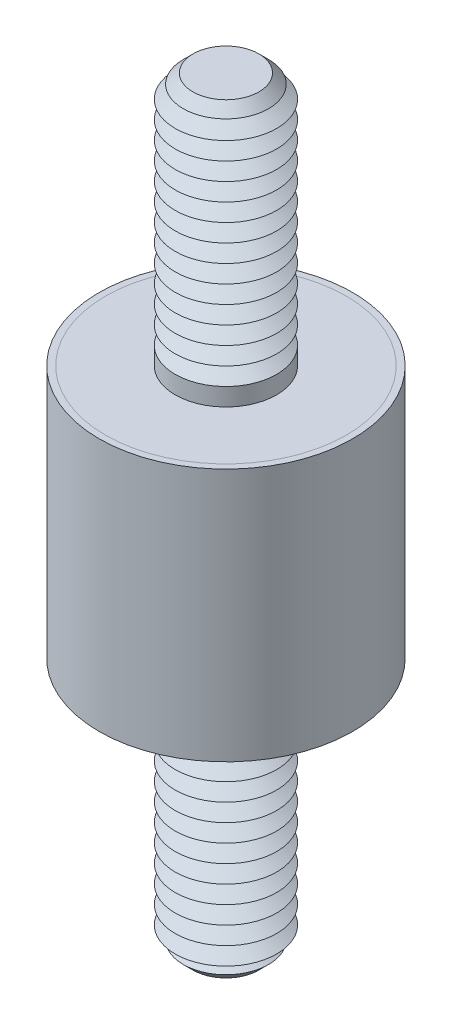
ISO-10303-21;
HEADER;
FILE_DESCRIPTION(('STEP AP214'),'2;1');
FILE_NAME('part.step','',(''),(''),'','','');
FILE_SCHEMA(('AUTOMOTIVE_DESIGN { 1 0 10303 214 1 1 1 1 }'));
ENDSEC;
DATA;
#1=APPLICATION_CONTEXT('core data for automotive mechanical design processes');
#2=APPLICATION_PROTOCOL_DEFINITION('international standard','automotive_design',2000,#1);
#3=PRODUCT_CONTEXT('',#1,'mechanical');
#4=PRODUCT('Part','Part','',(#3));
#5=PRODUCT_RELATED_PRODUCT_CATEGORY('part','',(#4));
#6=PRODUCT_DEFINITION_FORMATION('','',#4);
#7=PRODUCT_DEFINITION_CONTEXT('part definition',#1,'design');
#8=PRODUCT_DEFINITION('design','',#6,#7);
#9=PRODUCT_DEFINITION_SHAPE('','',#8);
#10=(LENGTH_UNIT() NAMED_UNIT(*) SI_UNIT(.MILLI.,.METRE.));
#11=(NAMED_UNIT(*) PLANE_ANGLE_UNIT() SI_UNIT($,.RADIAN.));
#12=(NAMED_UNIT(*) SI_UNIT($,.STERADIAN.) SOLID_ANGLE_UNIT());
#13=UNCERTAINTY_MEASURE_WITH_UNIT(LENGTH_MEASURE(1.E-05),#10,'distance_accuracy_value','');
#14=(GEOMETRIC_REPRESENTATION_CONTEXT(3) GLOBAL_UNCERTAINTY_ASSIGNED_CONTEXT((#13)) GLOBAL_UNIT_ASSIGNED_CONTEXT((#10,
#11,#12)) REPRESENTATION_CONTEXT('',''));
#15=CARTESIAN_POINT('',(0.,0.,0.));
#16=DIRECTION('',(0.,0.,1.));
#17=DIRECTION('',(1.,0.,0.));
#18=AXIS2_PLACEMENT_3D('',#15,#16,#17);
#19=CARTESIAN_POINT('',(0.,-15.,0.));
#20=DIRECTION('',(0.,1.,0.));
#21=DIRECTION('',(0.,0.,1.));
#22=AXIS2_PLACEMENT_3D('',#19,#20,#21);
#23=CYLINDRICAL_SURFACE('',#22,2.);
#24=CARTESIAN_POINT('',(0.,-5.,0.));
#25=DIRECTION('',(0.,-1.,0.));
#26=DIRECTION('',(0.,0.,-1.));
#27=AXIS2_PLACEMENT_3D('',#24,#25,#26);
#28=CIRCLE('',#27,2.);
#29=CARTESIAN_POINT('',(0.,-5.,-2.));
#30=VERTEX_POINT('',#29);
#31=EDGE_CURVE('P0_E22',#30,#30,#28,.T.);
#32=ORIENTED_EDGE('',*,*,#31,.T.);
#33=EDGE_LOOP('',(#32));
#34=FACE_BOUND('',#33,.T.);
#35=CARTESIAN_POINT('',(0.,-5.7,0.));
#36=DIRECTION('',(0.,1.,0.));
#37=DIRECTION('',(0.,0.,1.));
#38=AXIS2_PLACEMENT_3D('',#35,#36,#37);
#39=CIRCLE('',#38,2.);
#40=CARTESIAN_POINT('',(0.,-5.7,2.));
#41=VERTEX_POINT('',#40);
#42=EDGE_CURVE('P0_E32',#41,#41,#39,.T.);
#43=ORIENTED_EDGE('',*,*,#42,.T.);
#44=EDGE_LOOP('',(#43));
#45=FACE_BOUND('',#44,.T.);
#46=ADVANCED_FACE('P0_F14',(#34,#45),#23,.T.);
#47=CARTESIAN_POINT('',(0.,-5.,0.));
#48=DIRECTION('',(0.,1.,0.));
#49=DIRECTION('',(0.,0.,1.));
#50=AXIS2_PLACEMENT_3D('',#47,#48,#49);
#51=CYLINDRICAL_SURFACE('',#50,4.75);
#52=CARTESIAN_POINT('',(0.,-5.,0.));
#53=DIRECTION('',(0.,1.,0.));
#54=DIRECTION('',(0.,0.,1.));
#55=AXIS2_PLACEMENT_3D('',#52,#53,#54);
#56=CIRCLE('',#55,4.75);
#57=CARTESIAN_POINT('',(0.,-5.,4.75));
#58=VERTEX_POINT('',#57);
#59=EDGE_CURVE('P0_E26',#58,#58,#56,.T.);
#60=ORIENTED_EDGE('',*,*,#59,.T.);
#61=EDGE_LOOP('',(#60));
#62=FACE_BOUND('',#61,.T.);
#63=CARTESIAN_POINT('',(0.,-4.5,0.));
#64=DIRECTION('',(0.,1.,0.));
#65=DIRECTION('',(0.,0.,1.));
#66=AXIS2_PLACEMENT_3D('',#63,#64,#65);
#67=CIRCLE('',#66,4.75);
#68=CARTESIAN_POINT('',(0.,-4.5,4.75));
#69=VERTEX_POINT('',#68);
#70=EDGE_CURVE('P0_E29',#69,#69,#67,.T.);
#71=ORIENTED_EDGE('',*,*,#70,.F.);
#72=EDGE_LOOP('',(#71));
#73=FACE_BOUND('',#72,.T.);
#74=ADVANCED_FACE('P0_F131',(#62,#73),#51,.T.);
#75=CARTESIAN_POINT('',(0.,-5.,0.));
#76=DIRECTION('',(0.,1.,0.));
#77=DIRECTION('',(0.,0.,1.));
#78=AXIS2_PLACEMENT_3D('',#75,#76,#77);
#79=PLANE('',#78);
#80=ORIENTED_EDGE('',*,*,#31,.F.);
#81=EDGE_LOOP('',(#80));
#82=FACE_BOUND('',#81,.T.);
#83=ORIENTED_EDGE('',*,*,#59,.F.);
#84=EDGE_LOOP('',(#83));
#85=FACE_BOUND('',#84,.T.);
#86=ADVANCED_FACE('P0_F137',(#82,#85),#79,.F.);
#87=CARTESIAN_POINT('',(0.,-4.5,0.));
#88=DIRECTION('',(0.,1.,0.));
#89=DIRECTION('',(0.,0.,1.));
#90=AXIS2_PLACEMENT_3D('',#87,#88,#89);
#91=PLANE('',#90);
#92=ORIENTED_EDGE('',*,*,#70,.T.);
#93=EDGE_LOOP('',(#92));
#94=FACE_BOUND('',#93,.T.);
#95=ADVANCED_FACE('P0_F144',(#94),#91,.T.);
#96=CARTESIAN_POINT('',(0.,-5.7,0.));
#97=DIRECTION('',(0.,1.,0.));
#98=DIRECTION('',(0.,0.,1.));
#99=AXIS2_PLACEMENT_3D('',#96,#97,#98);
#100=CONICAL_SURFACE('',#99,2.,1.0471975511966);
#101=CARTESIAN_POINT('',(0.,-6.05,0.));
#102=DIRECTION('',(0.,1.,0.));
#103=DIRECTION('',(0.,0.,1.));
#104=AXIS2_PLACEMENT_3D('',#101,#102,#103);
#105=CIRCLE('',#104,1.39378221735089);
#106=CARTESIAN_POINT('',(0.,-6.05,1.39378221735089));
#107=VERTEX_POINT('',#106);
#108=EDGE_CURVE('P0_E37',#107,#107,#105,.T.);
#109=ORIENTED_EDGE('',*,*,#108,.T.);
#110=EDGE_LOOP('',(#109));
#111=FACE_BOUND('',#110,.T.);
#112=ORIENTED_EDGE('',*,*,#42,.F.);
#113=EDGE_LOOP('',(#112));
#114=FACE_BOUND('',#113,.T.);
#115=ADVANCED_FACE('P0_F147',(#111,#114),#100,.T.);
#116=CARTESIAN_POINT('',(0.,-6.05,0.));
#117=DIRECTION('',(0.,-1.,0.));
#118=DIRECTION('',(0.,0.,-1.));
#119=AXIS2_PLACEMENT_3D('',#116,#117,#118);
#120=CONICAL_SURFACE('',#119,1.39378221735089,1.0471975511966);
#121=CARTESIAN_POINT('',(0.,-6.4,0.));
#122=DIRECTION('',(0.,1.,0.));
#123=DIRECTION('',(0.,0.,1.));
#124=AXIS2_PLACEMENT_3D('',#121,#122,#123);
#125=CIRCLE('',#124,2.);
#126=CARTESIAN_POINT('',(0.,-6.4,2.));
#127=VERTEX_POINT('',#126);
#128=EDGE_CURVE('P0_E40',#127,#127,#125,.T.);
#129=ORIENTED_EDGE('',*,*,#128,.T.);
#130=EDGE_LOOP('',(#129));
#131=FACE_BOUND('',#130,.T.);
#132=ORIENTED_EDGE('',*,*,#108,.F.);
#133=EDGE_LOOP('',(#132));
#134=FACE_BOUND('',#133,.T.);
#135=ADVANCED_FACE('P0_F152',(#131,#134),#120,.T.);
#136=CARTESIAN_POINT('',(0.,-6.4,0.));
#137=DIRECTION('',(0.,1.,0.));
#138=DIRECTION('',(0.,0.,1.));
#139=AXIS2_PLACEMENT_3D('',#136,#137,#138);
#140=CONICAL_SURFACE('',#139,2.,1.0471975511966);
#141=CARTESIAN_POINT('',(0.,-6.75,0.));
#142=DIRECTION('',(0.,1.,0.));
#143=DIRECTION('',(0.,0.,1.));
#144=AXIS2_PLACEMENT_3D('',#141,#142,#143);
#145=CIRCLE('',#144,1.39378221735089);
#146=CARTESIAN_POINT('',(0.,-6.75,1.39378221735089));
#147=VERTEX_POINT('',#146);
#148=EDGE_CURVE('P0_E43',#147,#147,#145,.T.);
#149=ORIENTED_EDGE('',*,*,#148,.T.);
#150=EDGE_LOOP('',(#149));
#151=FACE_BOUND('',#150,.T.);
#152=ORIENTED_EDGE('',*,*,#128,.F.);
#153=EDGE_LOOP('',(#152));
#154=FACE_BOUND('',#153,.T.);
#155=ADVANCED_FACE('P0_F159',(#151,#154),#140,.T.);
#156=CARTESIAN_POINT('',(0.,-6.75,0.));
#157=DIRECTION('',(0.,-1.,0.));
#158=DIRECTION('',(0.,0.,-1.));
#159=AXIS2_PLACEMENT_3D('',#156,#157,#158);
#160=CONICAL_SURFACE('',#159,1.39378221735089,1.0471975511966);
#161=CARTESIAN_POINT('',(0.,-7.1,0.));
#162=DIRECTION('',(0.,1.,0.));
#163=DIRECTION('',(0.,0.,1.));
#164=AXIS2_PLACEMENT_3D('',#161,#162,#163);
#165=CIRCLE('',#164,2.);
#166=CARTESIAN_POINT('',(0.,-7.1,2.));
#167=VERTEX_POINT('',#166);
#168=EDGE_CURVE('P0_E46',#167,#167,#165,.T.);
#169=ORIENTED_EDGE('',*,*,#168,.T.);
#170=EDGE_LOOP('',(#169));
#171=FACE_BOUND('',#170,.T.);
#172=ORIENTED_EDGE('',*,*,#148,.F.);
#173=EDGE_LOOP('',(#172));
#174=FACE_BOUND('',#173,.T.);
#175=ADVANCED_FACE('P0_F166',(#171,#174),#160,.T.);
#176=CARTESIAN_POINT('',(0.,-7.1,0.));
#177=DIRECTION('',(0.,1.,0.));
#178=DIRECTION('',(0.,0.,1.));
#179=AXIS2_PLACEMENT_3D('',#176,#177,#178);
#180=CONICAL_SURFACE('',#179,2.,1.0471975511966);
#181=CARTESIAN_POINT('',(0.,-7.45,0.));
#182=DIRECTION('',(0.,1.,0.));
#183=DIRECTION('',(0.,0.,1.));
#184=AXIS2_PLACEMENT_3D('',#181,#182,#183);
#185=CIRCLE('',#184,1.39378221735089);
#186=CARTESIAN_POINT('',(0.,-7.45,1.39378221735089));
#187=VERTEX_POINT('',#186);
#188=EDGE_CURVE('P0_E49',#187,#187,#185,.T.);
#189=ORIENTED_EDGE('',*,*,#188,.T.);
#190=EDGE_LOOP('',(#189));
#191=FACE_BOUND('',#190,.T.);
#192=ORIENTED_EDGE('',*,*,#168,.F.);
#193=EDGE_LOOP('',(#192));
#194=FACE_BOUND('',#193,.T.);
#195=ADVANCED_FACE('P0_F170',(#191,#194),#180,.T.);
#196=CARTESIAN_POINT('',(0.,-7.45,0.));
#197=DIRECTION('',(0.,-1.,0.));
#198=DIRECTION('',(0.,0.,-1.));
#199=AXIS2_PLACEMENT_3D('',#196,#197,#198);
#200=CONICAL_SURFACE('',#199,1.39378221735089,1.0471975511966);
#201=CARTESIAN_POINT('',(0.,-7.8,0.));
#202=DIRECTION('',(0.,1.,0.));
#203=DIRECTION('',(0.,0.,1.));
#204=AXIS2_PLACEMENT_3D('',#201,#202,#203);
#205=CIRCLE('',#204,2.);
#206=CARTESIAN_POINT('',(0.,-7.8,2.));
#207=VERTEX_POINT('',#206);
#208=EDGE_CURVE('P0_E52',#207,#207,#205,.T.);
#209=ORIENTED_EDGE('',*,*,#208,.T.);
#210=EDGE_LOOP('',(#209));
#211=FACE_BOUND('',#210,.T.);
#212=ORIENTED_EDGE('',*,*,#188,.F.);
#213=EDGE_LOOP('',(#212));
#214=FACE_BOUND('',#213,.T.);
#215=ADVANCED_FACE('P0_F174',(#211,#214),#200,.T.);
#216=CARTESIAN_POINT('',(0.,-7.8,0.));
#217=DIRECTION('',(0.,1.,0.));
#218=DIRECTION('',(0.,0.,1.));
#219=AXIS2_PLACEMENT_3D('',#216,#217,#218);
#220=CONICAL_SURFACE('',#219,2.,1.0471975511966);
#221=CARTESIAN_POINT('',(0.,-8.15,0.));
#222=DIRECTION('',(0.,1.,0.));
#223=DIRECTION('',(0.,0.,1.));
#224=AXIS2_PLACEMENT_3D('',#221,#222,#223);
#225=CIRCLE('',#224,1.39378221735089);
#226=CARTESIAN_POINT('',(0.,-8.15,1.39378221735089));
#227=VERTEX_POINT('',#226);
#228=EDGE_CURVE('P0_E55',#227,#227,#225,.T.);
#229=ORIENTED_EDGE('',*,*,#228,.T.);
#230=EDGE_LOOP('',(#229));
#231=FACE_BOUND('',#230,.T.);
#232=ORIENTED_EDGE('',*,*,#208,.F.);
#233=EDGE_LOOP('',(#232));
#234=FACE_BOUND('',#233,.T.);
#235=ADVANCED_FACE('P0_F178',(#231,#234),#220,.T.);
#236=CARTESIAN_POINT('',(0.,-8.15,0.));
#237=DIRECTION('',(0.,-1.,0.));
#238=DIRECTION('',(0.,0.,-1.));
#239=AXIS2_PLACEMENT_3D('',#236,#237,#238);
#240=CONICAL_SURFACE('',#239,1.39378221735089,1.0471975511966);
#241=CARTESIAN_POINT('',(0.,-8.5,0.));
#242=DIRECTION('',(0.,1.,0.));
#243=DIRECTION('',(0.,0.,1.));
#244=AXIS2_PLACEMENT_3D('',#241,#242,#243);
#245=CIRCLE('',#244,2.);
#246=CARTESIAN_POINT('',(0.,-8.5,2.));
#247=VERTEX_POINT('',#246);
#248=EDGE_CURVE('P0_E58',#247,#247,#245,.T.);
#249=ORIENTED_EDGE('',*,*,#248,.T.);
#250=EDGE_LOOP('',(#249));
#251=FACE_BOUND('',#250,.T.);
#252=ORIENTED_EDGE('',*,*,#228,.F.);
#253=EDGE_LOOP('',(#252));
#254=FACE_BOUND('',#253,.T.);
#255=ADVANCED_FACE('P0_F182',(#251,#254),#240,.T.);
#256=CARTESIAN_POINT('',(0.,-8.5,0.));
#257=DIRECTION('',(0.,1.,0.));
#258=DIRECTION('',(0.,0.,1.));
#259=AXIS2_PLACEMENT_3D('',#256,#257,#258);
#260=CONICAL_SURFACE('',#259,2.,1.0471975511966);
#261=CARTESIAN_POINT('',(0.,-8.85,0.));
#262=DIRECTION('',(0.,1.,0.));
#263=DIRECTION('',(0.,0.,1.));
#264=AXIS2_PLACEMENT_3D('',#261,#262,#263);
#265=CIRCLE('',#264,1.39378221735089);
#266=CARTESIAN_POINT('',(0.,-8.85,1.39378221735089));
#267=VERTEX_POINT('',#266);
#268=EDGE_CURVE('P0_E61',#267,#267,#265,.T.);
#269=ORIENTED_EDGE('',*,*,#268,.T.);
#270=EDGE_LOOP('',(#269));
#271=FACE_BOUND('',#270,.T.);
#272=ORIENTED_EDGE('',*,*,#248,.F.);
#273=EDGE_LOOP('',(#272));
#274=FACE_BOUND('',#273,.T.);
#275=ADVANCED_FACE('P0_F186',(#271,#274),#260,.T.);
#276=CARTESIAN_POINT('',(0.,-8.85,0.));
#277=DIRECTION('',(0.,-1.,0.));
#278=DIRECTION('',(0.,0.,-1.));
#279=AXIS2_PLACEMENT_3D('',#276,#277,#278);
#280=CONICAL_SURFACE('',#279,1.39378221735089,1.0471975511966);
#281=CARTESIAN_POINT('',(0.,-9.2,0.));
#282=DIRECTION('',(0.,1.,0.));
#283=DIRECTION('',(0.,0.,1.));
#284=AXIS2_PLACEMENT_3D('',#281,#282,#283);
#285=CIRCLE('',#284,2.);
#286=CARTESIAN_POINT('',(0.,-9.2,2.));
#287=VERTEX_POINT('',#286);
#288=EDGE_CURVE('P0_E64',#287,#287,#285,.T.);
#289=ORIENTED_EDGE('',*,*,#288,.T.);
#290=EDGE_LOOP('',(#289));
#291=FACE_BOUND('',#290,.T.);
#292=ORIENTED_EDGE('',*,*,#268,.F.);
#293=EDGE_LOOP('',(#292));
#294=FACE_BOUND('',#293,.T.);
#295=ADVANCED_FACE('P0_F190',(#291,#294),#280,.T.);
#296=CARTESIAN_POINT('',(0.,-9.2,0.));
#297=DIRECTION('',(0.,1.,0.));
#298=DIRECTION('',(0.,0.,1.));
#299=AXIS2_PLACEMENT_3D('',#296,#297,#298);
#300=CONICAL_SURFACE('',#299,2.,1.0471975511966);
#301=CARTESIAN_POINT('',(0.,-9.55,0.));
#302=DIRECTION('',(0.,1.,0.));
#303=DIRECTION('',(0.,0.,1.));
#304=AXIS2_PLACEMENT_3D('',#301,#302,#303);
#305=CIRCLE('',#304,1.39378221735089);
#306=CARTESIAN_POINT('',(0.,-9.55,1.39378221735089));
#307=VERTEX_POINT('',#306);
#308=EDGE_CURVE('P0_E67',#307,#307,#305,.T.);
#309=ORIENTED_EDGE('',*,*,#308,.T.);
#310=EDGE_LOOP('',(#309));
#311=FACE_BOUND('',#310,.T.);
#312=ORIENTED_EDGE('',*,*,#288,.F.);
#313=EDGE_LOOP('',(#312));
#314=FACE_BOUND('',#313,.T.);
#315=ADVANCED_FACE('P0_F194',(#311,#314),#300,.T.);
#316=CARTESIAN_POINT('',(0.,-9.55,0.));
#317=DIRECTION('',(0.,-1.,0.));
#318=DIRECTION('',(0.,0.,-1.));
#319=AXIS2_PLACEMENT_3D('',#316,#317,#318);
#320=CONICAL_SURFACE('',#319,1.39378221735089,1.0471975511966);
#321=CARTESIAN_POINT('',(0.,-9.9,0.));
#322=DIRECTION('',(0.,1.,0.));
#323=DIRECTION('',(0.,0.,1.));
#324=AXIS2_PLACEMENT_3D('',#321,#322,#323);
#325=CIRCLE('',#324,2.);
#326=CARTESIAN_POINT('',(0.,-9.9,2.));
#327=VERTEX_POINT('',#326);
#328=EDGE_CURVE('P0_E70',#327,#327,#325,.T.);
#329=ORIENTED_EDGE('',*,*,#328,.T.);
#330=EDGE_LOOP('',(#329));
#331=FACE_BOUND('',#330,.T.);
#332=ORIENTED_EDGE('',*,*,#308,.F.);
#333=EDGE_LOOP('',(#332));
#334=FACE_BOUND('',#333,.T.);
#335=ADVANCED_FACE('P0_F198',(#331,#334),#320,.T.);
#336=CARTESIAN_POINT('',(0.,-9.9,0.));
#337=DIRECTION('',(0.,1.,0.));
#338=DIRECTION('',(0.,0.,1.));
#339=AXIS2_PLACEMENT_3D('',#336,#337,#338);
#340=CONICAL_SURFACE('',#339,2.,1.0471975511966);
#341=CARTESIAN_POINT('',(0.,-10.25,0.));
#342=DIRECTION('',(0.,1.,0.));
#343=DIRECTION('',(0.,0.,1.));
#344=AXIS2_PLACEMENT_3D('',#341,#342,#343);
#345=CIRCLE('',#344,1.39378221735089);
#346=CARTESIAN_POINT('',(0.,-10.25,1.39378221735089));
#347=VERTEX_POINT('',#346);
#348=EDGE_CURVE('P0_E73',#347,#347,#345,.T.);
#349=ORIENTED_EDGE('',*,*,#348,.T.);
#350=EDGE_LOOP('',(#349));
#351=FACE_BOUND('',#350,.T.);
#352=ORIENTED_EDGE('',*,*,#328,.F.);
#353=EDGE_LOOP('',(#352));
#354=FACE_BOUND('',#353,.T.);
#355=ADVANCED_FACE('P0_F202',(#351,#354),#340,.T.);
#356=CARTESIAN_POINT('',(0.,-10.25,0.));
#357=DIRECTION('',(0.,-1.,0.));
#358=DIRECTION('',(0.,0.,-1.));
#359=AXIS2_PLACEMENT_3D('',#356,#357,#358);
#360=CONICAL_SURFACE('',#359,1.39378221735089,1.0471975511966);
#361=CARTESIAN_POINT('',(0.,-10.6,0.));
#362=DIRECTION('',(0.,1.,0.));
#363=DIRECTION('',(0.,0.,1.));
#364=AXIS2_PLACEMENT_3D('',#361,#362,#363);
#365=CIRCLE('',#364,2.);
#366=CARTESIAN_POINT('',(0.,-10.6,2.));
#367=VERTEX_POINT('',#366);
#368=EDGE_CURVE('P0_E76',#367,#367,#365,.T.);
#369=ORIENTED_EDGE('',*,*,#368,.T.);
#370=EDGE_LOOP('',(#369));
#371=FACE_BOUND('',#370,.T.);
#372=ORIENTED_EDGE('',*,*,#348,.F.);
#373=EDGE_LOOP('',(#372));
#374=FACE_BOUND('',#373,.T.);
#375=ADVANCED_FACE('P0_F206',(#371,#374),#360,.T.);
#376=CARTESIAN_POINT('',(0.,-10.6,0.));
#377=DIRECTION('',(0.,1.,0.));
#378=DIRECTION('',(0.,0.,1.));
#379=AXIS2_PLACEMENT_3D('',#376,#377,#378);
#380=CONICAL_SURFACE('',#379,2.,1.0471975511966);
#381=CARTESIAN_POINT('',(0.,-10.95,0.));
#382=DIRECTION('',(0.,1.,0.));
#383=DIRECTION('',(0.,0.,1.));
#384=AXIS2_PLACEMENT_3D('',#381,#382,#383);
#385=CIRCLE('',#384,1.39378221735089);
#386=CARTESIAN_POINT('',(0.,-10.95,1.39378221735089));
#387=VERTEX_POINT('',#386);
#388=EDGE_CURVE('P0_E79',#387,#387,#385,.T.);
#389=ORIENTED_EDGE('',*,*,#388,.T.);
#390=EDGE_LOOP('',(#389));
#391=FACE_BOUND('',#390,.T.);
#392=ORIENTED_EDGE('',*,*,#368,.F.);
#393=EDGE_LOOP('',(#392));
#394=FACE_BOUND('',#393,.T.);
#395=ADVANCED_FACE('P0_F210',(#391,#394),#380,.T.);
#396=CARTESIAN_POINT('',(0.,-10.95,0.));
#397=DIRECTION('',(0.,-1.,0.));
#398=DIRECTION('',(0.,0.,-1.));
#399=AXIS2_PLACEMENT_3D('',#396,#397,#398);
#400=CONICAL_SURFACE('',#399,1.39378221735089,1.0471975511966);
#401=CARTESIAN_POINT('',(0.,-11.3,0.));
#402=DIRECTION('',(0.,1.,0.));
#403=DIRECTION('',(0.,0.,1.));
#404=AXIS2_PLACEMENT_3D('',#401,#402,#403);
#405=CIRCLE('',#404,2.);
#406=CARTESIAN_POINT('',(0.,-11.3,2.));
#407=VERTEX_POINT('',#406);
#408=EDGE_CURVE('P0_E82',#407,#407,#405,.T.);
#409=ORIENTED_EDGE('',*,*,#408,.T.);
#410=EDGE_LOOP('',(#409));
#411=FACE_BOUND('',#410,.T.);
#412=ORIENTED_EDGE('',*,*,#388,.F.);
#413=EDGE_LOOP('',(#412));
#414=FACE_BOUND('',#413,.T.);
#415=ADVANCED_FACE('P0_F214',(#411,#414),#400,.T.);
#416=CARTESIAN_POINT('',(0.,-11.3,0.));
#417=DIRECTION('',(0.,1.,0.));
#418=DIRECTION('',(0.,0.,1.));
#419=AXIS2_PLACEMENT_3D('',#416,#417,#418);
#420=CONICAL_SURFACE('',#419,2.,1.0471975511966);
#421=CARTESIAN_POINT('',(0.,-11.65,0.));
#422=DIRECTION('',(0.,1.,0.));
#423=DIRECTION('',(0.,0.,1.));
#424=AXIS2_PLACEMENT_3D('',#421,#422,#423);
#425=CIRCLE('',#424,1.39378221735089);
#426=CARTESIAN_POINT('',(0.,-11.65,1.39378221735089));
#427=VERTEX_POINT('',#426);
#428=EDGE_CURVE('P0_E85',#427,#427,#425,.T.);
#429=ORIENTED_EDGE('',*,*,#428,.T.);
#430=EDGE_LOOP('',(#429));
#431=FACE_BOUND('',#430,.T.);
#432=ORIENTED_EDGE('',*,*,#408,.F.);
#433=EDGE_LOOP('',(#432));
#434=FACE_BOUND('',#433,.T.);
#435=ADVANCED_FACE('P0_F218',(#431,#434),#420,.T.);
#436=CARTESIAN_POINT('',(0.,-11.65,0.));
#437=DIRECTION('',(0.,-1.,0.));
#438=DIRECTION('',(0.,0.,-1.));
#439=AXIS2_PLACEMENT_3D('',#436,#437,#438);
#440=CONICAL_SURFACE('',#439,1.39378221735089,1.0471975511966);
#441=CARTESIAN_POINT('',(0.,-12.,0.));
#442=DIRECTION('',(0.,1.,0.));
#443=DIRECTION('',(0.,0.,1.));
#444=AXIS2_PLACEMENT_3D('',#441,#442,#443);
#445=CIRCLE('',#444,2.);
#446=CARTESIAN_POINT('',(0.,-12.,2.));
#447=VERTEX_POINT('',#446);
#448=EDGE_CURVE('P0_E88',#447,#447,#445,.T.);
#449=ORIENTED_EDGE('',*,*,#448,.T.);
#450=EDGE_LOOP('',(#449));
#451=FACE_BOUND('',#450,.T.);
#452=ORIENTED_EDGE('',*,*,#428,.F.);
#453=EDGE_LOOP('',(#452));
#454=FACE_BOUND('',#453,.T.);
#455=ADVANCED_FACE('P0_F222',(#451,#454),#440,.T.);
#456=CARTESIAN_POINT('',(0.,-12.,0.));
#457=DIRECTION('',(0.,1.,0.));
#458=DIRECTION('',(0.,0.,1.));
#459=AXIS2_PLACEMENT_3D('',#456,#457,#458);
#460=CONICAL_SURFACE('',#459,2.,1.0471975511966);
#461=CARTESIAN_POINT('',(0.,-12.35,0.));
#462=DIRECTION('',(0.,1.,0.));
#463=DIRECTION('',(0.,0.,1.));
#464=AXIS2_PLACEMENT_3D('',#461,#462,#463);
#465=CIRCLE('',#464,1.39378221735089);
#466=CARTESIAN_POINT('',(0.,-12.35,1.39378221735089));
#467=VERTEX_POINT('',#466);
#468=EDGE_CURVE('P0_E91',#467,#467,#465,.T.);
#469=ORIENTED_EDGE('',*,*,#468,.T.);
#470=EDGE_LOOP('',(#469));
#471=FACE_BOUND('',#470,.T.);
#472=ORIENTED_EDGE('',*,*,#448,.F.);
#473=EDGE_LOOP('',(#472));
#474=FACE_BOUND('',#473,.T.);
#475=ADVANCED_FACE('P0_F226',(#471,#474),#460,.T.);
#476=CARTESIAN_POINT('',(0.,-12.35,0.));
#477=DIRECTION('',(0.,-1.,0.));
#478=DIRECTION('',(0.,0.,-1.));
#479=AXIS2_PLACEMENT_3D('',#476,#477,#478);
#480=CONICAL_SURFACE('',#479,1.39378221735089,1.0471975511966);
#481=CARTESIAN_POINT('',(0.,-12.7,0.));
#482=DIRECTION('',(0.,1.,0.));
#483=DIRECTION('',(0.,0.,1.));
#484=AXIS2_PLACEMENT_3D('',#481,#482,#483);
#485=CIRCLE('',#484,2.);
#486=CARTESIAN_POINT('',(0.,-12.7,2.));
#487=VERTEX_POINT('',#486);
#488=EDGE_CURVE('P0_E94',#487,#487,#485,.T.);
#489=ORIENTED_EDGE('',*,*,#488,.T.);
#490=EDGE_LOOP('',(#489));
#491=FACE_BOUND('',#490,.T.);
#492=ORIENTED_EDGE('',*,*,#468,.F.);
#493=EDGE_LOOP('',(#492));
#494=FACE_BOUND('',#493,.T.);
#495=ADVANCED_FACE('P0_F230',(#491,#494),#480,.T.);
#496=CARTESIAN_POINT('',(0.,-12.7,0.));
#497=DIRECTION('',(0.,1.,0.));
#498=DIRECTION('',(0.,0.,1.));
#499=AXIS2_PLACEMENT_3D('',#496,#497,#498);
#500=CONICAL_SURFACE('',#499,2.,1.0471975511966);
#501=CARTESIAN_POINT('',(0.,-13.05,0.));
#502=DIRECTION('',(0.,1.,0.));
#503=DIRECTION('',(0.,0.,1.));
#504=AXIS2_PLACEMENT_3D('',#501,#502,#503);
#505=CIRCLE('',#504,1.39378221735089);
#506=CARTESIAN_POINT('',(0.,-13.05,1.39378221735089));
#507=VERTEX_POINT('',#506);
#508=EDGE_CURVE('P0_E97',#507,#507,#505,.T.);
#509=ORIENTED_EDGE('',*,*,#508,.T.);
#510=EDGE_LOOP('',(#509));
#511=FACE_BOUND('',#510,.T.);
#512=ORIENTED_EDGE('',*,*,#488,.F.);
#513=EDGE_LOOP('',(#512));
#514=FACE_BOUND('',#513,.T.);
#515=ADVANCED_FACE('P0_F234',(#511,#514),#500,.T.);
#516=CARTESIAN_POINT('',(0.,-13.05,0.));
#517=DIRECTION('',(0.,-1.,0.));
#518=DIRECTION('',(0.,0.,-1.));
#519=AXIS2_PLACEMENT_3D('',#516,#517,#518);
#520=CONICAL_SURFACE('',#519,1.39378221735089,1.0471975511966);
#521=CARTESIAN_POINT('',(0.,-13.4,0.));
#522=DIRECTION('',(0.,1.,0.));
#523=DIRECTION('',(0.,0.,1.));
#524=AXIS2_PLACEMENT_3D('',#521,#522,#523);
#525=CIRCLE('',#524,2.);
#526=CARTESIAN_POINT('',(0.,-13.4,2.));
#527=VERTEX_POINT('',#526);
#528=EDGE_CURVE('P0_E100',#527,#527,#525,.T.);
#529=ORIENTED_EDGE('',*,*,#528,.T.);
#530=EDGE_LOOP('',(#529));
#531=FACE_BOUND('',#530,.T.);
#532=ORIENTED_EDGE('',*,*,#508,.F.);
#533=EDGE_LOOP('',(#532));
#534=FACE_BOUND('',#533,.T.);
#535=ADVANCED_FACE('P0_F238',(#531,#534),#520,.T.);
#536=CARTESIAN_POINT('',(0.,-13.4,0.));
#537=DIRECTION('',(0.,1.,0.));
#538=DIRECTION('',(0.,0.,1.));
#539=AXIS2_PLACEMENT_3D('',#536,#537,#538);
#540=CONICAL_SURFACE('',#539,2.,1.0471975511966);
#541=CARTESIAN_POINT('',(0.,-13.75,0.));
#542=DIRECTION('',(0.,1.,0.));
#543=DIRECTION('',(0.,0.,1.));
#544=AXIS2_PLACEMENT_3D('',#541,#542,#543);
#545=CIRCLE('',#544,1.39378221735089);
#546=CARTESIAN_POINT('',(0.,-13.75,1.39378221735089));
#547=VERTEX_POINT('',#546);
#548=EDGE_CURVE('P0_E103',#547,#547,#545,.T.);
#549=ORIENTED_EDGE('',*,*,#548,.T.);
#550=EDGE_LOOP('',(#549));
#551=FACE_BOUND('',#550,.T.);
#552=ORIENTED_EDGE('',*,*,#528,.F.);
#553=EDGE_LOOP('',(#552));
#554=FACE_BOUND('',#553,.T.);
#555=ADVANCED_FACE('P0_F242',(#551,#554),#540,.T.);
#556=CARTESIAN_POINT('',(0.,-13.75,0.));
#557=DIRECTION('',(0.,-1.,0.));
#558=DIRECTION('',(0.,0.,-1.));
#559=AXIS2_PLACEMENT_3D('',#556,#557,#558);
#560=CONICAL_SURFACE('',#559,1.39378221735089,1.0471975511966);
#561=CARTESIAN_POINT('',(0.,-14.1,0.));
#562=DIRECTION('',(0.,1.,0.));
#563=DIRECTION('',(0.,0.,1.));
#564=AXIS2_PLACEMENT_3D('',#561,#562,#563);
#565=CIRCLE('',#564,2.);
#566=CARTESIAN_POINT('',(0.,-14.1,2.));
#567=VERTEX_POINT('',#566);
#568=EDGE_CURVE('P0_E106',#567,#567,#565,.T.);
#569=ORIENTED_EDGE('',*,*,#568,.T.);
#570=EDGE_LOOP('',(#569));
#571=FACE_BOUND('',#570,.T.);
#572=ORIENTED_EDGE('',*,*,#548,.F.);
#573=EDGE_LOOP('',(#572));
#574=FACE_BOUND('',#573,.T.);
#575=ADVANCED_FACE('P0_F127',(#571,#574),#560,.T.);
#576=CARTESIAN_POINT('',(0.,-14.1,0.));
#577=DIRECTION('',(0.,1.,0.));
#578=DIRECTION('',(0.,0.,1.));
#579=AXIS2_PLACEMENT_3D('',#576,#577,#578);
#580=CONICAL_SURFACE('',#579,2.,1.0471975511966);
#581=CARTESIAN_POINT('',(0.,-14.45,0.));
#582=DIRECTION('',(0.,1.,0.));
#583=DIRECTION('',(0.,0.,1.));
#584=AXIS2_PLACEMENT_3D('',#581,#582,#583);
#585=CIRCLE('',#584,1.39378221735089);
#586=CARTESIAN_POINT('',(0.,-14.45,1.39378221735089));
#587=VERTEX_POINT('',#586);
#588=EDGE_CURVE('P0_E109',#587,#587,#585,.T.);
#589=ORIENTED_EDGE('',*,*,#588,.T.);
#590=EDGE_LOOP('',(#589));
#591=FACE_BOUND('',#590,.T.);
#592=ORIENTED_EDGE('',*,*,#568,.F.);
#593=EDGE_LOOP('',(#592));
#594=FACE_BOUND('',#593,.T.);
#595=ADVANCED_FACE('P0_F113',(#591,#594),#580,.T.);
#596=CARTESIAN_POINT('',(0.,-14.45,0.));
#597=DIRECTION('',(0.,-1.,0.));
#598=DIRECTION('',(0.,0.,-1.));
#599=AXIS2_PLACEMENT_3D('',#596,#597,#598);
#600=CONICAL_SURFACE('',#599,1.39378221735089,1.0471975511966);
#601=CARTESIAN_POINT('',(0.,-14.6169872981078,0.));
#602=DIRECTION('',(0.,-1.,0.));
#603=DIRECTION('',(0.,0.,-1.));
#604=AXIS2_PLACEMENT_3D('',#601,#602,#603);
#605=CIRCLE('',#604,1.68301270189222);
#606=CARTESIAN_POINT('',(0.,-14.6169872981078,1.68301270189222));
#607=VERTEX_POINT('',#606);
#608=EDGE_CURVE('P0_E18',#607,#607,#605,.T.);
#609=ORIENTED_EDGE('',*,*,#608,.F.);
#610=EDGE_LOOP('',(#609));
#611=FACE_BOUND('',#610,.T.);
#612=ORIENTED_EDGE('',*,*,#588,.F.);
#613=EDGE_LOOP('',(#612));
#614=FACE_BOUND('',#613,.T.);
#615=ADVANCED_FACE('P0_F116',(#611,#614),#600,.T.);
#616=CARTESIAN_POINT('',(0.,-15.,0.));
#617=DIRECTION('',(0.,-1.,0.));
#618=DIRECTION('',(0.,0.,-1.));
#619=AXIS2_PLACEMENT_3D('',#616,#617,#618);
#620=PLANE('',#619);
#621=CARTESIAN_POINT('',(0.,-15.,0.));
#622=DIRECTION('',(0.,-1.,0.));
#623=DIRECTION('',(0.,0.,-1.));
#624=AXIS2_PLACEMENT_3D('',#621,#622,#623);
#625=CIRCLE('',#624,1.3);
#626=CARTESIAN_POINT('',(0.,-15.,1.30000000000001));
#627=VERTEX_POINT('',#626);
#628=EDGE_CURVE('P0_E10',#627,#627,#625,.T.);
#629=ORIENTED_EDGE('',*,*,#628,.T.);
#630=EDGE_LOOP('',(#629));
#631=FACE_BOUND('',#630,.T.);
#632=ADVANCED_FACE('P0_F118',(#631),#620,.T.);
#633=CARTESIAN_POINT('',(0.,-15.,0.));
#634=DIRECTION('',(0.,1.,0.));
#635=DIRECTION('',(0.,0.,1.));
#636=AXIS2_PLACEMENT_3D('',#633,#634,#635);
#637=CONICAL_SURFACE('',#636,1.3,0.785398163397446);
#638=CARTESIAN_POINT('',(0.,-15.,1.30000000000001));
#639=CARTESIAN_POINT('',(0.,-14.9960102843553,1.30398971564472));
#640=CARTESIAN_POINT('',(0.,-14.9920205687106,1.30797943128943));
#641=CARTESIAN_POINT('',(0.,-14.9840411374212,1.31595886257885));
#642=CARTESIAN_POINT('',(0.,-14.9800514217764,1.31994857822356));
#643=CARTESIAN_POINT('',(0.,-14.972071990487,1.32792800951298));
#644=CARTESIAN_POINT('',(0.,-14.9680822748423,1.33191772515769));
#645=CARTESIAN_POINT('',(0.,-14.9601028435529,1.33989715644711));
#646=CARTESIAN_POINT('',(0.,-14.9561131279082,1.34388687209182));
#647=CARTESIAN_POINT('',(0.,-14.9481336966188,1.35186630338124));
#648=CARTESIAN_POINT('',(0.,-14.9441439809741,1.35585601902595));
#649=CARTESIAN_POINT('',(0.,-14.9361645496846,1.36383545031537));
#650=CARTESIAN_POINT('',(0.,-14.9321748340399,1.36782516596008));
#651=CARTESIAN_POINT('',(0.,-14.9241954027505,1.37580459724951));
#652=CARTESIAN_POINT('',(0.,-14.9202056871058,1.37979431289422));
#653=CARTESIAN_POINT('',(0.,-14.9122262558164,1.38777374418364));
#654=CARTESIAN_POINT('',(0.,-14.9082365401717,1.39176345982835));
#655=CARTESIAN_POINT('',(0.,-14.9002571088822,1.39974289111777));
#656=CARTESIAN_POINT('',(0.,-14.8962673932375,1.40373260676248));
#657=CARTESIAN_POINT('',(0.,-14.8882879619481,1.4117120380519));
#658=CARTESIAN_POINT('',(0.,-14.8842982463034,1.41570175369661));
#659=CARTESIAN_POINT('',(0.,-14.876318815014,1.42368118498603));
#660=CARTESIAN_POINT('',(0.,-14.8723290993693,1.42767090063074));
#661=CARTESIAN_POINT('',(0.,-14.8643496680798,1.43565033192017));
#662=CARTESIAN_POINT('',(0.,-14.8603599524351,1.43964004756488));
#663=CARTESIAN_POINT('',(0.,-14.8523805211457,1.4476194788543));
#664=CARTESIAN_POINT('',(0.,-14.848390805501,1.45160919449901));
#665=CARTESIAN_POINT('',(0.,-14.8404113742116,1.45958862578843));
#666=CARTESIAN_POINT('',(0.,-14.8364216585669,1.46357834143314));
#667=CARTESIAN_POINT('',(0.,-14.8284422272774,1.47155777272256));
#668=CARTESIAN_POINT('',(0.,-14.8244525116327,1.47554748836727));
#669=CARTESIAN_POINT('',(0.,-14.8164730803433,1.48352691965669));
#670=CARTESIAN_POINT('',(0.,-14.8124833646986,1.4875166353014));
#671=CARTESIAN_POINT('',(0.,-14.8045039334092,1.49549606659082));
#672=CARTESIAN_POINT('',(0.,-14.8005142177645,1.49948578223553));
#673=CARTESIAN_POINT('',(0.,-14.792534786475,1.50746521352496));
#674=CARTESIAN_POINT('',(0.,-14.7885450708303,1.51145492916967));
#675=CARTESIAN_POINT('',(0.,-14.7805656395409,1.51943436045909));
#676=CARTESIAN_POINT('',(0.,-14.7765759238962,1.5234240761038));
#677=CARTESIAN_POINT('',(0.,-14.7685964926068,1.53140350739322));
#678=CARTESIAN_POINT('',(0.,-14.7646067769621,1.53539322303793));
#679=CARTESIAN_POINT('',(0.,-14.7566273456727,1.54337265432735));
#680=CARTESIAN_POINT('',(0.,-14.7526376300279,1.54736236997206));
#681=CARTESIAN_POINT('',(0.,-14.7446581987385,1.55534180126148));
#682=CARTESIAN_POINT('',(0.,-14.7406684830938,1.55933151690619));
#683=CARTESIAN_POINT('',(0.,-14.7326890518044,1.56731094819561));
#684=CARTESIAN_POINT('',(0.,-14.7286993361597,1.57130066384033));
#685=CARTESIAN_POINT('',(0.,-14.7207199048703,1.57928009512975));
#686=CARTESIAN_POINT('',(0.,-14.7167301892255,1.58326981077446));
#687=CARTESIAN_POINT('',(0.,-14.7087507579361,1.59124924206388));
#688=CARTESIAN_POINT('',(0.,-14.7047610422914,1.59523895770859));
#689=CARTESIAN_POINT('',(0.,-14.696781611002,1.60321838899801));
#690=CARTESIAN_POINT('',(0.,-14.6927918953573,1.60720810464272));
#691=CARTESIAN_POINT('',(0.,-14.6848124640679,1.61518753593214));
#692=CARTESIAN_POINT('',(0.,-14.6808227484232,1.61917725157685));
#693=CARTESIAN_POINT('',(0.,-14.6728433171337,1.62715668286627));
#694=CARTESIAN_POINT('',(0.,-14.668853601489,1.63114639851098));
#695=CARTESIAN_POINT('',(0.,-14.6608741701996,1.63912582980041));
#696=CARTESIAN_POINT('',(0.,-14.6568844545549,1.64311554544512));
#697=CARTESIAN_POINT('',(0.,-14.6489050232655,1.65109497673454));
#698=CARTESIAN_POINT('',(0.,-14.6449153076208,1.65508469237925));
#699=CARTESIAN_POINT('',(0.,-14.6369358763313,1.66306412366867));
#700=CARTESIAN_POINT('',(0.,-14.6329461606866,1.66705383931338));
#701=CARTESIAN_POINT('',(0.,-14.6249667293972,1.6750332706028));
#702=CARTESIAN_POINT('',(0.,-14.6209770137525,1.67902298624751));
#703=CARTESIAN_POINT('',(0.,-14.6169872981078,1.68301270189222));
#704=B_SPLINE_CURVE_WITH_KNOTS('',3,(#638,#639,#640,#641,#642,#643,#644,#645,#646,#647,#648,
#649,#650,#651,#652,#653,#654,#655,#656,#657,#658,#659,#660,#661,#662,#663,#664,#665,#666,#667,
#668,#669,#670,#671,#672,#673,#674,#675,#676,#677,#678,#679,#680,#681,#682,#683,#684,#685,#686,
#687,#688,#689,#690,#691,#692,#693,#694,#695,#696,#697,#698,#699,#700,#701,#702,#703),
.UNSPECIFIED.,.F.,.F.,(4,2,2,2,2,2,2,2,2,2,2,2,2,2,2,2,2,2,2,2,2,2,2,2,2,2,2,2,2,2,2,2,4),(0.,
0.0169269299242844,0.0338538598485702,0.050780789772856,0.0677077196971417,0.0846346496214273,
0.101561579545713,0.118488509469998,0.135415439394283,0.152342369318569,0.169269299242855,
0.18619622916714,0.203123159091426,0.220050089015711,0.236977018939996,0.253903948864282,
0.270830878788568,0.287757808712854,0.304684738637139,0.321611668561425,0.33853859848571,
0.355465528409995,0.372392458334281,0.389319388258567,0.406246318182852,0.423173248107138,
0.440100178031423,0.457027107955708,0.473954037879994,0.49088096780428,0.507807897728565,
0.524734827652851,0.541661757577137),.UNSPECIFIED.);
#705=EDGE_CURVE('P0_BSEAM16',#627,#607,#704,.T.);
#706=ORIENTED_EDGE('',*,*,#628,.F.);
#707=ORIENTED_EDGE('',*,*,#608,.T.);
#708=ORIENTED_EDGE('',*,*,#705,.T.);
#709=ORIENTED_EDGE('',*,*,#705,.F.);
#710=EDGE_LOOP('',(#706,#708,#707,#709));
#711=FACE_BOUND('',#710,.T.);
#712=ADVANCED_FACE('P0_F16',(#711),#637,.T.);
#713=CLOSED_SHELL('',(#46,#74,#86,#95,#115,#135,#155,#175,#195,#215,#235,#255,#275,#295,#315,
#335,#355,#375,#395,#415,#435,#455,#475,#495,#515,#535,#555,#575,#595,#615,#632,#712));
#714=MANIFOLD_SOLID_BREP('P0_B1',#713);
#715=CARTESIAN_POINT('',(0.,15.,0.));
#716=DIRECTION('',(0.,-1.,0.));
#717=DIRECTION('',(0.,0.,-1.));
#718=AXIS2_PLACEMENT_3D('',#715,#716,#717);
#719=CYLINDRICAL_SURFACE('',#718,2.);
#720=CARTESIAN_POINT('',(0.,5.7,0.));
#721=DIRECTION('',(0.,1.,0.));
#722=DIRECTION('',(0.,0.,1.));
#723=AXIS2_PLACEMENT_3D('',#720,#721,#722);
#724=CIRCLE('',#723,2.);
#725=CARTESIAN_POINT('',(0.,5.7,2.));
#726=VERTEX_POINT('',#725);
#727=EDGE_CURVE('P1_E32',#726,#726,#724,.T.);
#728=ORIENTED_EDGE('',*,*,#727,.F.);
#729=EDGE_LOOP('',(#728));
#730=FACE_BOUND('',#729,.T.);
#731=CARTESIAN_POINT('',(0.,5.,0.));
#732=DIRECTION('',(0.,1.,0.));
#733=DIRECTION('',(0.,0.,1.));
#734=AXIS2_PLACEMENT_3D('',#731,#732,#733);
#735=CIRCLE('',#734,2.);
#736=CARTESIAN_POINT('',(0.,5.,2.));
#737=VERTEX_POINT('',#736);
#738=EDGE_CURVE('P1_E22',#737,#737,#735,.T.);
#739=ORIENTED_EDGE('',*,*,#738,.T.);
#740=EDGE_LOOP('',(#739));
#741=FACE_BOUND('',#740,.T.);
#742=ADVANCED_FACE('P1_F14',(#730,#741),#719,.T.);
#743=CARTESIAN_POINT('',(0.,5.,0.));
#744=DIRECTION('',(0.,-1.,0.));
#745=DIRECTION('',(0.,0.,-1.));
#746=AXIS2_PLACEMENT_3D('',#743,#744,#745);
#747=CYLINDRICAL_SURFACE('',#746,4.75);
#748=CARTESIAN_POINT('',(0.,5.,0.));
#749=DIRECTION('',(0.,1.,0.));
#750=DIRECTION('',(0.,0.,1.));
#751=AXIS2_PLACEMENT_3D('',#748,#749,#750);
#752=CIRCLE('',#751,4.75);
#753=CARTESIAN_POINT('',(0.,5.,4.75));
#754=VERTEX_POINT('',#753);
#755=EDGE_CURVE('P1_E26',#754,#754,#752,.T.);
#756=ORIENTED_EDGE('',*,*,#755,.F.);
#757=EDGE_LOOP('',(#756));
#758=FACE_BOUND('',#757,.T.);
#759=CARTESIAN_POINT('',(0.,4.5,0.));
#760=DIRECTION('',(0.,1.,0.));
#761=DIRECTION('',(0.,0.,1.));
#762=AXIS2_PLACEMENT_3D('',#759,#760,#761);
#763=CIRCLE('',#762,4.75);
#764=CARTESIAN_POINT('',(0.,4.5,4.75));
#765=VERTEX_POINT('',#764);
#766=EDGE_CURVE('P1_E29',#765,#765,#763,.T.);
#767=ORIENTED_EDGE('',*,*,#766,.T.);
#768=EDGE_LOOP('',(#767));
#769=FACE_BOUND('',#768,.T.);
#770=ADVANCED_FACE('P1_F268',(#758,#769),#747,.T.);
#771=CARTESIAN_POINT('',(0.,5.,0.));
#772=DIRECTION('',(0.,1.,0.));
#773=DIRECTION('',(0.,0.,1.));
#774=AXIS2_PLACEMENT_3D('',#771,#772,#773);
#775=PLANE('',#774);
#776=ORIENTED_EDGE('',*,*,#738,.F.);
#777=EDGE_LOOP('',(#776));
#778=FACE_BOUND('',#777,.T.);
#779=ORIENTED_EDGE('',*,*,#755,.T.);
#780=EDGE_LOOP('',(#779));
#781=FACE_BOUND('',#780,.T.);
#782=ADVANCED_FACE('P1_F272',(#778,#781),#775,.T.);
#783=CARTESIAN_POINT('',(0.,4.5,0.));
#784=DIRECTION('',(0.,1.,0.));
#785=DIRECTION('',(0.,0.,1.));
#786=AXIS2_PLACEMENT_3D('',#783,#784,#785);
#787=PLANE('',#786);
#788=ORIENTED_EDGE('',*,*,#766,.F.);
#789=EDGE_LOOP('',(#788));
#790=FACE_BOUND('',#789,.T.);
#791=ADVANCED_FACE('P1_F262',(#790),#787,.F.);
#792=CARTESIAN_POINT('',(0.,5.7,0.));
#793=DIRECTION('',(0.,-1.,0.));
#794=DIRECTION('',(0.,0.,-1.));
#795=AXIS2_PLACEMENT_3D('',#792,#793,#794);
#796=CONICAL_SURFACE('',#795,2.,1.0471975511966);
#797=CARTESIAN_POINT('',(0.,6.05,0.));
#798=DIRECTION('',(0.,1.,0.));
#799=DIRECTION('',(0.,0.,1.));
#800=AXIS2_PLACEMENT_3D('',#797,#798,#799);
#801=CIRCLE('',#800,1.39378221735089);
#802=CARTESIAN_POINT('',(0.,6.05,1.39378221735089));
#803=VERTEX_POINT('',#802);
#804=EDGE_CURVE('P1_E37',#803,#803,#801,.T.);
#805=ORIENTED_EDGE('',*,*,#804,.F.);
#806=EDGE_LOOP('',(#805));
#807=FACE_BOUND('',#806,.T.);
#808=ORIENTED_EDGE('',*,*,#727,.T.);
#809=EDGE_LOOP('',(#808));
#810=FACE_BOUND('',#809,.T.);
#811=ADVANCED_FACE('P1_F256',(#807,#810),#796,.T.);
#812=CARTESIAN_POINT('',(0.,6.05,0.));
#813=DIRECTION('',(0.,1.,0.));
#814=DIRECTION('',(0.,0.,1.));
#815=AXIS2_PLACEMENT_3D('',#812,#813,#814);
#816=CONICAL_SURFACE('',#815,1.39378221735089,1.0471975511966);
#817=CARTESIAN_POINT('',(0.,6.4,0.));
#818=DIRECTION('',(0.,1.,0.));
#819=DIRECTION('',(0.,0.,1.));
#820=AXIS2_PLACEMENT_3D('',#817,#818,#819);
#821=CIRCLE('',#820,2.);
#822=CARTESIAN_POINT('',(0.,6.4,2.));
#823=VERTEX_POINT('',#822);
#824=EDGE_CURVE('P1_E40',#823,#823,#821,.T.);
#825=ORIENTED_EDGE('',*,*,#824,.F.);
#826=EDGE_LOOP('',(#825));
#827=FACE_BOUND('',#826,.T.);
#828=ORIENTED_EDGE('',*,*,#804,.T.);
#829=EDGE_LOOP('',(#828));
#830=FACE_BOUND('',#829,.T.);
#831=ADVANCED_FACE('P1_F250',(#827,#830),#816,.T.);
#832=CARTESIAN_POINT('',(0.,6.4,0.));
#833=DIRECTION('',(0.,-1.,0.));
#834=DIRECTION('',(0.,0.,-1.));
#835=AXIS2_PLACEMENT_3D('',#832,#833,#834);
#836=CONICAL_SURFACE('',#835,2.,1.0471975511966);
#837=CARTESIAN_POINT('',(0.,6.75,0.));
#838=DIRECTION('',(0.,1.,0.));
#839=DIRECTION('',(0.,0.,1.));
#840=AXIS2_PLACEMENT_3D('',#837,#838,#839);
#841=CIRCLE('',#840,1.39378221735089);
#842=CARTESIAN_POINT('',(0.,6.75,1.39378221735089));
#843=VERTEX_POINT('',#842);
#844=EDGE_CURVE('P1_E43',#843,#843,#841,.T.);
#845=ORIENTED_EDGE('',*,*,#844,.F.);
#846=EDGE_LOOP('',(#845));
#847=FACE_BOUND('',#846,.T.);
#848=ORIENTED_EDGE('',*,*,#824,.T.);
#849=EDGE_LOOP('',(#848));
#850=FACE_BOUND('',#849,.T.);
#851=ADVANCED_FACE('P1_F244',(#847,#850),#836,.T.);
#852=CARTESIAN_POINT('',(0.,6.75,0.));
#853=DIRECTION('',(0.,1.,0.));
#854=DIRECTION('',(0.,0.,1.));
#855=AXIS2_PLACEMENT_3D('',#852,#853,#854);
#856=CONICAL_SURFACE('',#855,1.39378221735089,1.0471975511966);
#857=CARTESIAN_POINT('',(0.,7.1,0.));
#858=DIRECTION('',(0.,1.,0.));
#859=DIRECTION('',(0.,0.,1.));
#860=AXIS2_PLACEMENT_3D('',#857,#858,#859);
#861=CIRCLE('',#860,2.);
#862=CARTESIAN_POINT('',(0.,7.1,2.));
#863=VERTEX_POINT('',#862);
#864=EDGE_CURVE('P1_E46',#863,#863,#861,.T.);
#865=ORIENTED_EDGE('',*,*,#864,.F.);
#866=EDGE_LOOP('',(#865));
#867=FACE_BOUND('',#866,.T.);
#868=ORIENTED_EDGE('',*,*,#844,.T.);
#869=EDGE_LOOP('',(#868));
#870=FACE_BOUND('',#869,.T.);
#871=ADVANCED_FACE('P1_F238',(#867,#870),#856,.T.);
#872=CARTESIAN_POINT('',(0.,7.1,0.));
#873=DIRECTION('',(0.,-1.,0.));
#874=DIRECTION('',(0.,0.,-1.));
#875=AXIS2_PLACEMENT_3D('',#872,#873,#874);
#876=CONICAL_SURFACE('',#875,2.,1.0471975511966);
#877=CARTESIAN_POINT('',(0.,7.45,0.));
#878=DIRECTION('',(0.,1.,0.));
#879=DIRECTION('',(0.,0.,1.));
#880=AXIS2_PLACEMENT_3D('',#877,#878,#879);
#881=CIRCLE('',#880,1.39378221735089);
#882=CARTESIAN_POINT('',(0.,7.45,1.39378221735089));
#883=VERTEX_POINT('',#882);
#884=EDGE_CURVE('P1_E49',#883,#883,#881,.T.);
#885=ORIENTED_EDGE('',*,*,#884,.F.);
#886=EDGE_LOOP('',(#885));
#887=FACE_BOUND('',#886,.T.);
#888=ORIENTED_EDGE('',*,*,#864,.T.);
#889=EDGE_LOOP('',(#888));
#890=FACE_BOUND('',#889,.T.);
#891=ADVANCED_FACE('P1_F232',(#887,#890),#876,.T.);
#892=CARTESIAN_POINT('',(0.,7.45,0.));
#893=DIRECTION('',(0.,1.,0.));
#894=DIRECTION('',(0.,0.,1.));
#895=AXIS2_PLACEMENT_3D('',#892,#893,#894);
#896=CONICAL_SURFACE('',#895,1.39378221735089,1.0471975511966);
#897=CARTESIAN_POINT('',(0.,7.8,0.));
#898=DIRECTION('',(0.,1.,0.));
#899=DIRECTION('',(0.,0.,1.));
#900=AXIS2_PLACEMENT_3D('',#897,#898,#899);
#901=CIRCLE('',#900,2.);
#902=CARTESIAN_POINT('',(0.,7.8,2.));
#903=VERTEX_POINT('',#902);
#904=EDGE_CURVE('P1_E52',#903,#903,#901,.T.);
#905=ORIENTED_EDGE('',*,*,#904,.F.);
#906=EDGE_LOOP('',(#905));
#907=FACE_BOUND('',#906,.T.);
#908=ORIENTED_EDGE('',*,*,#884,.T.);
#909=EDGE_LOOP('',(#908));
#910=FACE_BOUND('',#909,.T.);
#911=ADVANCED_FACE('P1_F226',(#907,#910),#896,.T.);
#912=CARTESIAN_POINT('',(0.,7.8,0.));
#913=DIRECTION('',(0.,-1.,0.));
#914=DIRECTION('',(0.,0.,-1.));
#915=AXIS2_PLACEMENT_3D('',#912,#913,#914);
#916=CONICAL_SURFACE('',#915,2.,1.0471975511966);
#917=CARTESIAN_POINT('',(0.,8.15,0.));
#918=DIRECTION('',(0.,1.,0.));
#919=DIRECTION('',(0.,0.,1.));
#920=AXIS2_PLACEMENT_3D('',#917,#918,#919);
#921=CIRCLE('',#920,1.39378221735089);
#922=CARTESIAN_POINT('',(0.,8.15,1.39378221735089));
#923=VERTEX_POINT('',#922);
#924=EDGE_CURVE('P1_E55',#923,#923,#921,.T.);
#925=ORIENTED_EDGE('',*,*,#924,.F.);
#926=EDGE_LOOP('',(#925));
#927=FACE_BOUND('',#926,.T.);
#928=ORIENTED_EDGE('',*,*,#904,.T.);
#929=EDGE_LOOP('',(#928));
#930=FACE_BOUND('',#929,.T.);
#931=ADVANCED_FACE('P1_F220',(#927,#930),#916,.T.);
#932=CARTESIAN_POINT('',(0.,8.15,0.));
#933=DIRECTION('',(0.,1.,0.));
#934=DIRECTION('',(0.,0.,1.));
#935=AXIS2_PLACEMENT_3D('',#932,#933,#934);
#936=CONICAL_SURFACE('',#935,1.39378221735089,1.0471975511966);
#937=CARTESIAN_POINT('',(0.,8.5,0.));
#938=DIRECTION('',(0.,1.,0.));
#939=DIRECTION('',(0.,0.,1.));
#940=AXIS2_PLACEMENT_3D('',#937,#938,#939);
#941=CIRCLE('',#940,2.);
#942=CARTESIAN_POINT('',(0.,8.5,2.));
#943=VERTEX_POINT('',#942);
#944=EDGE_CURVE('P1_E58',#943,#943,#941,.T.);
#945=ORIENTED_EDGE('',*,*,#944,.F.);
#946=EDGE_LOOP('',(#945));
#947=FACE_BOUND('',#946,.T.);
#948=ORIENTED_EDGE('',*,*,#924,.T.);
#949=EDGE_LOOP('',(#948));
#950=FACE_BOUND('',#949,.T.);
#951=ADVANCED_FACE('P1_F214',(#947,#950),#936,.T.);
#952=CARTESIAN_POINT('',(0.,8.5,0.));
#953=DIRECTION('',(0.,-1.,0.));
#954=DIRECTION('',(0.,0.,-1.));
#955=AXIS2_PLACEMENT_3D('',#952,#953,#954);
#956=CONICAL_SURFACE('',#955,2.,1.0471975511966);
#957=CARTESIAN_POINT('',(0.,8.85,0.));
#958=DIRECTION('',(0.,1.,0.));
#959=DIRECTION('',(0.,0.,1.));
#960=AXIS2_PLACEMENT_3D('',#957,#958,#959);
#961=CIRCLE('',#960,1.39378221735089);
#962=CARTESIAN_POINT('',(0.,8.85,1.39378221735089));
#963=VERTEX_POINT('',#962);
#964=EDGE_CURVE('P1_E61',#963,#963,#961,.T.);
#965=ORIENTED_EDGE('',*,*,#964,.F.);
#966=EDGE_LOOP('',(#965));
#967=FACE_BOUND('',#966,.T.);
#968=ORIENTED_EDGE('',*,*,#944,.T.);
#969=EDGE_LOOP('',(#968));
#970=FACE_BOUND('',#969,.T.);
#971=ADVANCED_FACE('P1_F208',(#967,#970),#956,.T.);
#972=CARTESIAN_POINT('',(0.,8.85,0.));
#973=DIRECTION('',(0.,1.,0.));
#974=DIRECTION('',(0.,0.,1.));
#975=AXIS2_PLACEMENT_3D('',#972,#973,#974);
#976=CONICAL_SURFACE('',#975,1.39378221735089,1.0471975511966);
#977=CARTESIAN_POINT('',(0.,9.2,0.));
#978=DIRECTION('',(0.,1.,0.));
#979=DIRECTION('',(0.,0.,1.));
#980=AXIS2_PLACEMENT_3D('',#977,#978,#979);
#981=CIRCLE('',#980,2.);
#982=CARTESIAN_POINT('',(0.,9.2,2.));
#983=VERTEX_POINT('',#982);
#984=EDGE_CURVE('P1_E64',#983,#983,#981,.T.);
#985=ORIENTED_EDGE('',*,*,#984,.F.);
#986=EDGE_LOOP('',(#985));
#987=FACE_BOUND('',#986,.T.);
#988=ORIENTED_EDGE('',*,*,#964,.T.);
#989=EDGE_LOOP('',(#988));
#990=FACE_BOUND('',#989,.T.);
#991=ADVANCED_FACE('P1_F202',(#987,#990),#976,.T.);
#992=CARTESIAN_POINT('',(0.,9.2,0.));
#993=DIRECTION('',(0.,-1.,0.));
#994=DIRECTION('',(0.,0.,-1.));
#995=AXIS2_PLACEMENT_3D('',#992,#993,#994);
#996=CONICAL_SURFACE('',#995,2.,1.0471975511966);
#997=CARTESIAN_POINT('',(0.,9.55,0.));
#998=DIRECTION('',(0.,1.,0.));
#999=DIRECTION('',(0.,0.,1.));
#1000=AXIS2_PLACEMENT_3D('',#997,#998,#999);
#1001=CIRCLE('',#1000,1.39378221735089);
#1002=CARTESIAN_POINT('',(0.,9.55,1.39378221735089));
#1003=VERTEX_POINT('',#1002);
#1004=EDGE_CURVE('P1_E67',#1003,#1003,#1001,.T.);
#1005=ORIENTED_EDGE('',*,*,#1004,.F.);
#1006=EDGE_LOOP('',(#1005));
#1007=FACE_BOUND('',#1006,.T.);
#1008=ORIENTED_EDGE('',*,*,#984,.T.);
#1009=EDGE_LOOP('',(#1008));
#1010=FACE_BOUND('',#1009,.T.);
#1011=ADVANCED_FACE('P1_F196',(#1007,#1010),#996,.T.);
#1012=CARTESIAN_POINT('',(0.,9.55,0.));
#1013=DIRECTION('',(0.,1.,0.));
#1014=DIRECTION('',(0.,0.,1.));
#1015=AXIS2_PLACEMENT_3D('',#1012,#1013,#1014);
#1016=CONICAL_SURFACE('',#1015,1.39378221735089,1.0471975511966);
#1017=CARTESIAN_POINT('',(0.,9.9,0.));
#1018=DIRECTION('',(0.,1.,0.));
#1019=DIRECTION('',(0.,0.,1.));
#1020=AXIS2_PLACEMENT_3D('',#1017,#1018,#1019);
#1021=CIRCLE('',#1020,2.);
#1022=CARTESIAN_POINT('',(0.,9.9,2.));
#1023=VERTEX_POINT('',#1022);
#1024=EDGE_CURVE('P1_E70',#1023,#1023,#1021,.T.);
#1025=ORIENTED_EDGE('',*,*,#1024,.F.);
#1026=EDGE_LOOP('',(#1025));
#1027=FACE_BOUND('',#1026,.T.);
#1028=ORIENTED_EDGE('',*,*,#1004,.T.);
#1029=EDGE_LOOP('',(#1028));
#1030=FACE_BOUND('',#1029,.T.);
#1031=ADVANCED_FACE('P1_F190',(#1027,#1030),#1016,.T.);
#1032=CARTESIAN_POINT('',(0.,9.9,0.));
#1033=DIRECTION('',(0.,-1.,0.));
#1034=DIRECTION('',(0.,0.,-1.));
#1035=AXIS2_PLACEMENT_3D('',#1032,#1033,#1034);
#1036=CONICAL_SURFACE('',#1035,2.,1.0471975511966);
#1037=CARTESIAN_POINT('',(0.,10.25,0.));
#1038=DIRECTION('',(0.,1.,0.));
#1039=DIRECTION('',(0.,0.,1.));
#1040=AXIS2_PLACEMENT_3D('',#1037,#1038,#1039);
#1041=CIRCLE('',#1040,1.39378221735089);
#1042=CARTESIAN_POINT('',(0.,10.25,1.39378221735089));
#1043=VERTEX_POINT('',#1042);
#1044=EDGE_CURVE('P1_E73',#1043,#1043,#1041,.T.);
#1045=ORIENTED_EDGE('',*,*,#1044,.F.);
#1046=EDGE_LOOP('',(#1045));
#1047=FACE_BOUND('',#1046,.T.);
#1048=ORIENTED_EDGE('',*,*,#1024,.T.);
#1049=EDGE_LOOP('',(#1048));
#1050=FACE_BOUND('',#1049,.T.);
#1051=ADVANCED_FACE('P1_F184',(#1047,#1050),#1036,.T.);
#1052=CARTESIAN_POINT('',(0.,10.25,0.));
#1053=DIRECTION('',(0.,1.,0.));
#1054=DIRECTION('',(0.,0.,1.));
#1055=AXIS2_PLACEMENT_3D('',#1052,#1053,#1054);
#1056=CONICAL_SURFACE('',#1055,1.39378221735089,1.0471975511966);
#1057=CARTESIAN_POINT('',(0.,10.6,0.));
#1058=DIRECTION('',(0.,1.,0.));
#1059=DIRECTION('',(0.,0.,1.));
#1060=AXIS2_PLACEMENT_3D('',#1057,#1058,#1059);
#1061=CIRCLE('',#1060,2.);
#1062=CARTESIAN_POINT('',(0.,10.6,2.));
#1063=VERTEX_POINT('',#1062);
#1064=EDGE_CURVE('P1_E76',#1063,#1063,#1061,.T.);
#1065=ORIENTED_EDGE('',*,*,#1064,.F.);
#1066=EDGE_LOOP('',(#1065));
#1067=FACE_BOUND('',#1066,.T.);
#1068=ORIENTED_EDGE('',*,*,#1044,.T.);
#1069=EDGE_LOOP('',(#1068));
#1070=FACE_BOUND('',#1069,.T.);
#1071=ADVANCED_FACE('P1_F178',(#1067,#1070),#1056,.T.);
#1072=CARTESIAN_POINT('',(0.,10.6,0.));
#1073=DIRECTION('',(0.,-1.,0.));
#1074=DIRECTION('',(0.,0.,-1.));
#1075=AXIS2_PLACEMENT_3D('',#1072,#1073,#1074);
#1076=CONICAL_SURFACE('',#1075,2.,1.0471975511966);
#1077=CARTESIAN_POINT('',(0.,10.95,0.));
#1078=DIRECTION('',(0.,1.,0.));
#1079=DIRECTION('',(0.,0.,1.));
#1080=AXIS2_PLACEMENT_3D('',#1077,#1078,#1079);
#1081=CIRCLE('',#1080,1.39378221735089);
#1082=CARTESIAN_POINT('',(0.,10.95,1.39378221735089));
#1083=VERTEX_POINT('',#1082);
#1084=EDGE_CURVE('P1_E79',#1083,#1083,#1081,.T.);
#1085=ORIENTED_EDGE('',*,*,#1084,.F.);
#1086=EDGE_LOOP('',(#1085));
#1087=FACE_BOUND('',#1086,.T.);
#1088=ORIENTED_EDGE('',*,*,#1064,.T.);
#1089=EDGE_LOOP('',(#1088));
#1090=FACE_BOUND('',#1089,.T.);
#1091=ADVANCED_FACE('P1_F172',(#1087,#1090),#1076,.T.);
#1092=CARTESIAN_POINT('',(0.,10.95,0.));
#1093=DIRECTION('',(0.,1.,0.));
#1094=DIRECTION('',(0.,0.,1.));
#1095=AXIS2_PLACEMENT_3D('',#1092,#1093,#1094);
#1096=CONICAL_SURFACE('',#1095,1.39378221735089,1.0471975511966);
#1097=CARTESIAN_POINT('',(0.,11.3,0.));
#1098=DIRECTION('',(0.,1.,0.));
#1099=DIRECTION('',(0.,0.,1.));
#1100=AXIS2_PLACEMENT_3D('',#1097,#1098,#1099);
#1101=CIRCLE('',#1100,2.);
#1102=CARTESIAN_POINT('',(0.,11.3,2.));
#1103=VERTEX_POINT('',#1102);
#1104=EDGE_CURVE('P1_E82',#1103,#1103,#1101,.T.);
#1105=ORIENTED_EDGE('',*,*,#1104,.F.);
#1106=EDGE_LOOP('',(#1105));
#1107=FACE_BOUND('',#1106,.T.);
#1108=ORIENTED_EDGE('',*,*,#1084,.T.);
#1109=EDGE_LOOP('',(#1108));
#1110=FACE_BOUND('',#1109,.T.);
#1111=ADVANCED_FACE('P1_F166',(#1107,#1110),#1096,.T.);
#1112=CARTESIAN_POINT('',(0.,11.3,0.));
#1113=DIRECTION('',(0.,-1.,0.));
#1114=DIRECTION('',(0.,0.,-1.));
#1115=AXIS2_PLACEMENT_3D('',#1112,#1113,#1114);
#1116=CONICAL_SURFACE('',#1115,2.,1.0471975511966);
#1117=CARTESIAN_POINT('',(0.,11.65,0.));
#1118=DIRECTION('',(0.,1.,0.));
#1119=DIRECTION('',(0.,0.,1.));
#1120=AXIS2_PLACEMENT_3D('',#1117,#1118,#1119);
#1121=CIRCLE('',#1120,1.39378221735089);
#1122=CARTESIAN_POINT('',(0.,11.65,1.39378221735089));
#1123=VERTEX_POINT('',#1122);
#1124=EDGE_CURVE('P1_E85',#1123,#1123,#1121,.T.);
#1125=ORIENTED_EDGE('',*,*,#1124,.F.);
#1126=EDGE_LOOP('',(#1125));
#1127=FACE_BOUND('',#1126,.T.);
#1128=ORIENTED_EDGE('',*,*,#1104,.T.);
#1129=EDGE_LOOP('',(#1128));
#1130=FACE_BOUND('',#1129,.T.);
#1131=ADVANCED_FACE('P1_F160',(#1127,#1130),#1116,.T.);
#1132=CARTESIAN_POINT('',(0.,11.65,0.));
#1133=DIRECTION('',(0.,1.,0.));
#1134=DIRECTION('',(0.,0.,1.));
#1135=AXIS2_PLACEMENT_3D('',#1132,#1133,#1134);
#1136=CONICAL_SURFACE('',#1135,1.39378221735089,1.0471975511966);
#1137=CARTESIAN_POINT('',(0.,12.,0.));
#1138=DIRECTION('',(0.,1.,0.));
#1139=DIRECTION('',(0.,0.,1.));
#1140=AXIS2_PLACEMENT_3D('',#1137,#1138,#1139);
#1141=CIRCLE('',#1140,2.);
#1142=CARTESIAN_POINT('',(0.,12.,2.));
#1143=VERTEX_POINT('',#1142);
#1144=EDGE_CURVE('P1_E88',#1143,#1143,#1141,.T.);
#1145=ORIENTED_EDGE('',*,*,#1144,.F.);
#1146=EDGE_LOOP('',(#1145));
#1147=FACE_BOUND('',#1146,.T.);
#1148=ORIENTED_EDGE('',*,*,#1124,.T.);
#1149=EDGE_LOOP('',(#1148));
#1150=FACE_BOUND('',#1149,.T.);
#1151=ADVANCED_FACE('P1_F154',(#1147,#1150),#1136,.T.);
#1152=CARTESIAN_POINT('',(0.,12.,0.));
#1153=DIRECTION('',(0.,-1.,0.));
#1154=DIRECTION('',(0.,0.,-1.));
#1155=AXIS2_PLACEMENT_3D('',#1152,#1153,#1154);
#1156=CONICAL_SURFACE('',#1155,2.,1.0471975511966);
#1157=CARTESIAN_POINT('',(0.,12.35,0.));
#1158=DIRECTION('',(0.,1.,0.));
#1159=DIRECTION('',(0.,0.,1.));
#1160=AXIS2_PLACEMENT_3D('',#1157,#1158,#1159);
#1161=CIRCLE('',#1160,1.39378221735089);
#1162=CARTESIAN_POINT('',(0.,12.35,1.39378221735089));
#1163=VERTEX_POINT('',#1162);
#1164=EDGE_CURVE('P1_E91',#1163,#1163,#1161,.T.);
#1165=ORIENTED_EDGE('',*,*,#1164,.F.);
#1166=EDGE_LOOP('',(#1165));
#1167=FACE_BOUND('',#1166,.T.);
#1168=ORIENTED_EDGE('',*,*,#1144,.T.);
#1169=EDGE_LOOP('',(#1168));
#1170=FACE_BOUND('',#1169,.T.);
#1171=ADVANCED_FACE('P1_F148',(#1167,#1170),#1156,.T.);
#1172=CARTESIAN_POINT('',(0.,12.35,0.));
#1173=DIRECTION('',(0.,1.,0.));
#1174=DIRECTION('',(0.,0.,1.));
#1175=AXIS2_PLACEMENT_3D('',#1172,#1173,#1174);
#1176=CONICAL_SURFACE('',#1175,1.39378221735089,1.0471975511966);
#1177=CARTESIAN_POINT('',(0.,12.7,0.));
#1178=DIRECTION('',(0.,1.,0.));
#1179=DIRECTION('',(0.,0.,1.));
#1180=AXIS2_PLACEMENT_3D('',#1177,#1178,#1179);
#1181=CIRCLE('',#1180,2.);
#1182=CARTESIAN_POINT('',(0.,12.7,2.));
#1183=VERTEX_POINT('',#1182);
#1184=EDGE_CURVE('P1_E94',#1183,#1183,#1181,.T.);
#1185=ORIENTED_EDGE('',*,*,#1184,.F.);
#1186=EDGE_LOOP('',(#1185));
#1187=FACE_BOUND('',#1186,.T.);
#1188=ORIENTED_EDGE('',*,*,#1164,.T.);
#1189=EDGE_LOOP('',(#1188));
#1190=FACE_BOUND('',#1189,.T.);
#1191=ADVANCED_FACE('P1_F142',(#1187,#1190),#1176,.T.);
#1192=CARTESIAN_POINT('',(0.,12.7,0.));
#1193=DIRECTION('',(0.,-1.,0.));
#1194=DIRECTION('',(0.,0.,-1.));
#1195=AXIS2_PLACEMENT_3D('',#1192,#1193,#1194);
#1196=CONICAL_SURFACE('',#1195,2.,1.0471975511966);
#1197=CARTESIAN_POINT('',(0.,13.05,0.));
#1198=DIRECTION('',(0.,1.,0.));
#1199=DIRECTION('',(0.,0.,1.));
#1200=AXIS2_PLACEMENT_3D('',#1197,#1198,#1199);
#1201=CIRCLE('',#1200,1.39378221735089);
#1202=CARTESIAN_POINT('',(0.,13.05,1.39378221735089));
#1203=VERTEX_POINT('',#1202);
#1204=EDGE_CURVE('P1_E97',#1203,#1203,#1201,.T.);
#1205=ORIENTED_EDGE('',*,*,#1204,.F.);
#1206=EDGE_LOOP('',(#1205));
#1207=FACE_BOUND('',#1206,.T.);
#1208=ORIENTED_EDGE('',*,*,#1184,.T.);
#1209=EDGE_LOOP('',(#1208));
#1210=FACE_BOUND('',#1209,.T.);
#1211=ADVANCED_FACE('P1_F136',(#1207,#1210),#1196,.T.);
#1212=CARTESIAN_POINT('',(0.,13.05,0.));
#1213=DIRECTION('',(0.,1.,0.));
#1214=DIRECTION('',(0.,0.,1.));
#1215=AXIS2_PLACEMENT_3D('',#1212,#1213,#1214);
#1216=CONICAL_SURFACE('',#1215,1.39378221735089,1.0471975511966);
#1217=CARTESIAN_POINT('',(0.,13.4,0.));
#1218=DIRECTION('',(0.,1.,0.));
#1219=DIRECTION('',(0.,0.,1.));
#1220=AXIS2_PLACEMENT_3D('',#1217,#1218,#1219);
#1221=CIRCLE('',#1220,2.);
#1222=CARTESIAN_POINT('',(0.,13.4,2.));
#1223=VERTEX_POINT('',#1222);
#1224=EDGE_CURVE('P1_E100',#1223,#1223,#1221,.T.);
#1225=ORIENTED_EDGE('',*,*,#1224,.F.);
#1226=EDGE_LOOP('',(#1225));
#1227=FACE_BOUND('',#1226,.T.);
#1228=ORIENTED_EDGE('',*,*,#1204,.T.);
#1229=EDGE_LOOP('',(#1228));
#1230=FACE_BOUND('',#1229,.T.);
#1231=ADVANCED_FACE('P1_F130',(#1227,#1230),#1216,.T.);
#1232=CARTESIAN_POINT('',(0.,13.4,0.));
#1233=DIRECTION('',(0.,-1.,0.));
#1234=DIRECTION('',(0.,0.,-1.));
#1235=AXIS2_PLACEMENT_3D('',#1232,#1233,#1234);
#1236=CONICAL_SURFACE('',#1235,2.,1.0471975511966);
#1237=CARTESIAN_POINT('',(0.,13.75,0.));
#1238=DIRECTION('',(0.,1.,0.));
#1239=DIRECTION('',(0.,0.,1.));
#1240=AXIS2_PLACEMENT_3D('',#1237,#1238,#1239);
#1241=CIRCLE('',#1240,1.39378221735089);
#1242=CARTESIAN_POINT('',(0.,13.75,1.39378221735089));
#1243=VERTEX_POINT('',#1242);
#1244=EDGE_CURVE('P1_E103',#1243,#1243,#1241,.T.);
#1245=ORIENTED_EDGE('',*,*,#1244,.F.);
#1246=EDGE_LOOP('',(#1245));
#1247=FACE_BOUND('',#1246,.T.);
#1248=ORIENTED_EDGE('',*,*,#1224,.T.);
#1249=EDGE_LOOP('',(#1248));
#1250=FACE_BOUND('',#1249,.T.);
#1251=ADVANCED_FACE('P1_F124',(#1247,#1250),#1236,.T.);
#1252=CARTESIAN_POINT('',(0.,13.75,0.));
#1253=DIRECTION('',(0.,1.,0.));
#1254=DIRECTION('',(0.,0.,1.));
#1255=AXIS2_PLACEMENT_3D('',#1252,#1253,#1254);
#1256=CONICAL_SURFACE('',#1255,1.39378221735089,1.0471975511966);
#1257=CARTESIAN_POINT('',(0.,14.1,0.));
#1258=DIRECTION('',(0.,1.,0.));
#1259=DIRECTION('',(0.,0.,1.));
#1260=AXIS2_PLACEMENT_3D('',#1257,#1258,#1259);
#1261=CIRCLE('',#1260,2.);
#1262=CARTESIAN_POINT('',(0.,14.1,2.));
#1263=VERTEX_POINT('',#1262);
#1264=EDGE_CURVE('P1_E106',#1263,#1263,#1261,.T.);
#1265=ORIENTED_EDGE('',*,*,#1264,.F.);
#1266=EDGE_LOOP('',(#1265));
#1267=FACE_BOUND('',#1266,.T.);
#1268=ORIENTED_EDGE('',*,*,#1244,.T.);
#1269=EDGE_LOOP('',(#1268));
#1270=FACE_BOUND('',#1269,.T.);
#1271=ADVANCED_FACE('P1_F118',(#1267,#1270),#1256,.T.);
#1272=CARTESIAN_POINT('',(0.,14.1,0.));
#1273=DIRECTION('',(0.,-1.,0.));
#1274=DIRECTION('',(0.,0.,-1.));
#1275=AXIS2_PLACEMENT_3D('',#1272,#1273,#1274);
#1276=CONICAL_SURFACE('',#1275,2.,1.0471975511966);
#1277=CARTESIAN_POINT('',(0.,14.45,0.));
#1278=DIRECTION('',(0.,1.,0.));
#1279=DIRECTION('',(0.,0.,1.));
#1280=AXIS2_PLACEMENT_3D('',#1277,#1278,#1279);
#1281=CIRCLE('',#1280,1.39378221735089);
#1282=CARTESIAN_POINT('',(0.,14.45,1.39378221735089));
#1283=VERTEX_POINT('',#1282);
#1284=EDGE_CURVE('P1_E109',#1283,#1283,#1281,.T.);
#1285=ORIENTED_EDGE('',*,*,#1284,.F.);
#1286=EDGE_LOOP('',(#1285));
#1287=FACE_BOUND('',#1286,.T.);
#1288=ORIENTED_EDGE('',*,*,#1264,.T.);
#1289=EDGE_LOOP('',(#1288));
#1290=FACE_BOUND('',#1289,.T.);
#1291=ADVANCED_FACE('P1_F115',(#1287,#1290),#1276,.T.);
#1292=CARTESIAN_POINT('',(0.,14.45,0.));
#1293=DIRECTION('',(0.,1.,0.));
#1294=DIRECTION('',(0.,0.,1.));
#1295=AXIS2_PLACEMENT_3D('',#1292,#1293,#1294);
#1296=CONICAL_SURFACE('',#1295,1.39378221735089,1.0471975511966);
#1297=CARTESIAN_POINT('',(0.,14.6169872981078,0.));
#1298=DIRECTION('',(0.,1.,0.));
#1299=DIRECTION('',(0.,0.,1.));
#1300=AXIS2_PLACEMENT_3D('',#1297,#1298,#1299);
#1301=CIRCLE('',#1300,1.68301270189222);
#1302=CARTESIAN_POINT('',(0.,14.6169872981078,-1.68301270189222));
#1303=VERTEX_POINT('',#1302);
#1304=EDGE_CURVE('P1_E18',#1303,#1303,#1301,.F.);
#1305=ORIENTED_EDGE('',*,*,#1304,.T.);
#1306=EDGE_LOOP('',(#1305));
#1307=FACE_BOUND('',#1306,.T.);
#1308=ORIENTED_EDGE('',*,*,#1284,.T.);
#1309=EDGE_LOOP('',(#1308));
#1310=FACE_BOUND('',#1309,.T.);
#1311=ADVANCED_FACE('P1_F113',(#1307,#1310),#1296,.T.);
#1312=CARTESIAN_POINT('',(0.,15.,0.));
#1313=DIRECTION('',(0.,1.,0.));
#1314=DIRECTION('',(0.,0.,1.));
#1315=AXIS2_PLACEMENT_3D('',#1312,#1313,#1314);
#1316=PLANE('',#1315);
#1317=CARTESIAN_POINT('',(0.,15.,0.));
#1318=DIRECTION('',(0.,1.,0.));
#1319=DIRECTION('',(0.,0.,1.));
#1320=AXIS2_PLACEMENT_3D('',#1317,#1318,#1319);
#1321=CIRCLE('',#1320,1.3);
#1322=CARTESIAN_POINT('',(0.,15.,-1.30000000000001));
#1323=VERTEX_POINT('',#1322);
#1324=EDGE_CURVE('P1_E10',#1323,#1323,#1321,.T.);
#1325=ORIENTED_EDGE('',*,*,#1324,.T.);
#1326=EDGE_LOOP('',(#1325));
#1327=FACE_BOUND('',#1326,.T.);
#1328=ADVANCED_FACE('P1_F288',(#1327),#1316,.T.);
#1329=CARTESIAN_POINT('',(0.,15.,0.));
#1330=DIRECTION('',(0.,-1.,0.));
#1331=DIRECTION('',(0.,0.,-1.));
#1332=AXIS2_PLACEMENT_3D('',#1329,#1330,#1331);
#1333=CONICAL_SURFACE('',#1332,1.3,0.785398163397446);
#1334=CARTESIAN_POINT('',(0.,14.6169872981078,-1.68301270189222));
#1335=CARTESIAN_POINT('',(0.,14.6209770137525,-1.67902298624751));
#1336=CARTESIAN_POINT('',(0.,14.6249667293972,-1.6750332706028));
#1337=CARTESIAN_POINT('',(0.,14.6329461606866,-1.66705383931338));
#1338=CARTESIAN_POINT('',(0.,14.6369358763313,-1.66306412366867));
#1339=CARTESIAN_POINT('',(0.,14.6449153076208,-1.65508469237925));
#1340=CARTESIAN_POINT('',(0.,14.6489050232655,-1.65109497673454));
#1341=CARTESIAN_POINT('',(0.,14.6568844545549,-1.64311554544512));
#1342=CARTESIAN_POINT('',(0.,14.6608741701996,-1.63912582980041));
#1343=CARTESIAN_POINT('',(0.,14.668853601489,-1.63114639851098));
#1344=CARTESIAN_POINT('',(0.,14.6728433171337,-1.62715668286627));
#1345=CARTESIAN_POINT('',(0.,14.6808227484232,-1.61917725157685));
#1346=CARTESIAN_POINT('',(0.,14.6848124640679,-1.61518753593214));
#1347=CARTESIAN_POINT('',(0.,14.6927918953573,-1.60720810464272));
#1348=CARTESIAN_POINT('',(0.,14.696781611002,-1.60321838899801));
#1349=CARTESIAN_POINT('',(0.,14.7047610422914,-1.59523895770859));
#1350=CARTESIAN_POINT('',(0.,14.7087507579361,-1.59124924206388));
#1351=CARTESIAN_POINT('',(0.,14.7167301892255,-1.58326981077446));
#1352=CARTESIAN_POINT('',(0.,14.7207199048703,-1.57928009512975));
#1353=CARTESIAN_POINT('',(0.,14.7286993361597,-1.57130066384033));
#1354=CARTESIAN_POINT('',(0.,14.7326890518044,-1.56731094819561));
#1355=CARTESIAN_POINT('',(0.,14.7406684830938,-1.55933151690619));
#1356=CARTESIAN_POINT('',(0.,14.7446581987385,-1.55534180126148));
#1357=CARTESIAN_POINT('',(0.,14.7526376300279,-1.54736236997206));
#1358=CARTESIAN_POINT('',(0.,14.7566273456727,-1.54337265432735));
#1359=CARTESIAN_POINT('',(0.,14.7646067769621,-1.53539322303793));
#1360=CARTESIAN_POINT('',(0.,14.7685964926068,-1.53140350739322));
#1361=CARTESIAN_POINT('',(0.,14.7765759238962,-1.5234240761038));
#1362=CARTESIAN_POINT('',(0.,14.7805656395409,-1.51943436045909));
#1363=CARTESIAN_POINT('',(0.,14.7885450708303,-1.51145492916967));
#1364=CARTESIAN_POINT('',(0.,14.792534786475,-1.50746521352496));
#1365=CARTESIAN_POINT('',(0.,14.8005142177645,-1.49948578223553));
#1366=CARTESIAN_POINT('',(0.,14.8045039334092,-1.49549606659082));
#1367=CARTESIAN_POINT('',(0.,14.8124833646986,-1.4875166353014));
#1368=CARTESIAN_POINT('',(0.,14.8164730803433,-1.48352691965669));
#1369=CARTESIAN_POINT('',(0.,14.8244525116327,-1.47554748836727));
#1370=CARTESIAN_POINT('',(0.,14.8284422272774,-1.47155777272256));
#1371=CARTESIAN_POINT('',(0.,14.8364216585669,-1.46357834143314));
#1372=CARTESIAN_POINT('',(0.,14.8404113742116,-1.45958862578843));
#1373=CARTESIAN_POINT('',(0.,14.848390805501,-1.45160919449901));
#1374=CARTESIAN_POINT('',(0.,14.8523805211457,-1.4476194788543));
#1375=CARTESIAN_POINT('',(0.,14.8603599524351,-1.43964004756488));
#1376=CARTESIAN_POINT('',(0.,14.8643496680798,-1.43565033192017));
#1377=CARTESIAN_POINT('',(0.,14.8723290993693,-1.42767090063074));
#1378=CARTESIAN_POINT('',(0.,14.876318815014,-1.42368118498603));
#1379=CARTESIAN_POINT('',(0.,14.8842982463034,-1.41570175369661));
#1380=CARTESIAN_POINT('',(0.,14.8882879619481,-1.4117120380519));
#1381=CARTESIAN_POINT('',(0.,14.8962673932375,-1.40373260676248));
#1382=CARTESIAN_POINT('',(0.,14.9002571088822,-1.39974289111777));
#1383=CARTESIAN_POINT('',(0.,14.9082365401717,-1.39176345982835));
#1384=CARTESIAN_POINT('',(0.,14.9122262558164,-1.38777374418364));
#1385=CARTESIAN_POINT('',(0.,14.9202056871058,-1.37979431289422));
#1386=CARTESIAN_POINT('',(0.,14.9241954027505,-1.37580459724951));
#1387=CARTESIAN_POINT('',(0.,14.9321748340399,-1.36782516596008));
#1388=CARTESIAN_POINT('',(0.,14.9361645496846,-1.36383545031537));
#1389=CARTESIAN_POINT('',(0.,14.9441439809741,-1.35585601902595));
#1390=CARTESIAN_POINT('',(0.,14.9481336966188,-1.35186630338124));
#1391=CARTESIAN_POINT('',(0.,14.9561131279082,-1.34388687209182));
#1392=CARTESIAN_POINT('',(0.,14.9601028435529,-1.33989715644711));
#1393=CARTESIAN_POINT('',(0.,14.9680822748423,-1.33191772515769));
#1394=CARTESIAN_POINT('',(0.,14.972071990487,-1.32792800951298));
#1395=CARTESIAN_POINT('',(0.,14.9800514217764,-1.31994857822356));
#1396=CARTESIAN_POINT('',(0.,14.9840411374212,-1.31595886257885));
#1397=CARTESIAN_POINT('',(0.,14.9920205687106,-1.30797943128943));
#1398=CARTESIAN_POINT('',(0.,14.9960102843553,-1.30398971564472));
#1399=CARTESIAN_POINT('',(0.,15.,-1.30000000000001));
#1400=B_SPLINE_CURVE_WITH_KNOTS('',3,(#1334,#1335,#1336,#1337,#1338,#1339,#1340,#1341,#1342,
#1343,#1344,#1345,#1346,#1347,#1348,#1349,#1350,#1351,#1352,#1353,#1354,#1355,#1356,#1357,#1358,
#1359,#1360,#1361,#1362,#1363,#1364,#1365,#1366,#1367,#1368,#1369,#1370,#1371,#1372,#1373,#1374,
#1375,#1376,#1377,#1378,#1379,#1380,#1381,#1382,#1383,#1384,#1385,#1386,#1387,#1388,#1389,#1390,
#1391,#1392,#1393,#1394,#1395,#1396,#1397,#1398,#1399),.UNSPECIFIED.,.F.,.F.,(4,2,2,2,2,2,2,2,2,
2,2,2,2,2,2,2,2,2,2,2,2,2,2,2,2,2,2,2,2,2,2,2,4),(0.,0.0169269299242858,0.0338538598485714,
0.0507807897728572,0.0677077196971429,0.0846346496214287,0.101561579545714,0.118488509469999,
0.135415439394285,0.15234236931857,0.169269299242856,0.186196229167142,0.203123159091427,
0.220050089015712,0.236977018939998,0.253903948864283,0.270830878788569,0.287757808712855,
0.304684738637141,0.321611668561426,0.338538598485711,0.355465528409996,0.372392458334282,
0.389319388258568,0.406246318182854,0.423173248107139,0.440100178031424,0.45702710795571,
0.473954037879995,0.490880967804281,0.507807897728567,0.524734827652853,0.541661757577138),.UNSPECIFIED.);
#1401=EDGE_CURVE('P1_BSEAM16',#1303,#1323,#1400,.T.);
#1402=ORIENTED_EDGE('',*,*,#1304,.F.);
#1403=ORIENTED_EDGE('',*,*,#1324,.F.);
#1404=ORIENTED_EDGE('',*,*,#1401,.T.);
#1405=ORIENTED_EDGE('',*,*,#1401,.F.);
#1406=EDGE_LOOP('',(#1402,#1404,#1403,#1405));
#1407=FACE_BOUND('',#1406,.T.);
#1408=ADVANCED_FACE('P1_F16',(#1407),#1333,.T.);
#1409=CLOSED_SHELL('',(#742,#770,#782,#791,#811,#831,#851,#871,#891,#911,#931,#951,#971,#991,
#1011,#1031,#1051,#1071,#1091,#1111,#1131,#1151,#1171,#1191,#1211,#1231,#1251,#1271,#1291,#1311,
#1328,#1408));
#1410=MANIFOLD_SOLID_BREP('P1_B1',#1409);
#1411=CARTESIAN_POINT('',(0.,5.,0.));
#1412=DIRECTION('',(0.,-1.,0.));
#1413=DIRECTION('',(0.,0.,-1.));
#1414=AXIS2_PLACEMENT_3D('',#1411,#1412,#1413);
#1415=CYLINDRICAL_SURFACE('',#1414,5.);
#1416=CARTESIAN_POINT('',(0.,5.,0.));
#1417=DIRECTION('',(0.,1.,0.));
#1418=DIRECTION('',(0.,0.,1.));
#1419=AXIS2_PLACEMENT_3D('',#1416,#1417,#1418);
#1420=CIRCLE('',#1419,5.);
#1421=CARTESIAN_POINT('',(0.,5.,5.));
#1422=VERTEX_POINT('',#1421);
#1423=EDGE_CURVE('P2_E9',#1422,#1422,#1420,.T.);
#1424=ORIENTED_EDGE('',*,*,#1423,.F.);
#1425=EDGE_LOOP('',(#1424));
#1426=FACE_BOUND('',#1425,.T.);
#1427=CARTESIAN_POINT('',(0.,-5.,0.));
#1428=DIRECTION('',(0.,1.,0.));
#1429=DIRECTION('',(0.,0.,1.));
#1430=AXIS2_PLACEMENT_3D('',#1427,#1428,#1429);
#1431=CIRCLE('',#1430,5.);
#1432=CARTESIAN_POINT('',(0.,-5.,5.));
#1433=VERTEX_POINT('',#1432);
#1434=EDGE_CURVE('P2_E16',#1433,#1433,#1431,.T.);
#1435=ORIENTED_EDGE('',*,*,#1434,.T.);
#1436=EDGE_LOOP('',(#1435));
#1437=FACE_BOUND('',#1436,.T.);
#1438=ADVANCED_FACE('P2_F13',(#1426,#1437),#1415,.T.);
#1439=CARTESIAN_POINT('',(0.,5.,0.));
#1440=DIRECTION('',(0.,1.,0.));
#1441=DIRECTION('',(0.,0.,1.));
#1442=AXIS2_PLACEMENT_3D('',#1439,#1440,#1441);
#1443=PLANE('',#1442);
#1444=CARTESIAN_POINT('',(0.,5.,0.));
#1445=DIRECTION('',(0.,1.,0.));
#1446=DIRECTION('',(0.,0.,1.));
#1447=AXIS2_PLACEMENT_3D('',#1444,#1445,#1446);
#1448=CIRCLE('',#1447,4.75);
#1449=CARTESIAN_POINT('',(0.,5.,4.75));
#1450=VERTEX_POINT('',#1449);
#1451=EDGE_CURVE('P2_E25',#1450,#1450,#1448,.T.);
#1452=ORIENTED_EDGE('',*,*,#1451,.F.);
#1453=EDGE_LOOP('',(#1452));
#1454=FACE_BOUND('',#1453,.T.);
#1455=ORIENTED_EDGE('',*,*,#1423,.T.);
#1456=EDGE_LOOP('',(#1455));
#1457=FACE_BOUND('',#1456,.T.);
#1458=ADVANCED_FACE('P2_F50',(#1454,#1457),#1443,.T.);
#1459=CARTESIAN_POINT('',(0.,-5.,0.));
#1460=DIRECTION('',(0.,1.,0.));
#1461=DIRECTION('',(0.,0.,1.));
#1462=AXIS2_PLACEMENT_3D('',#1459,#1460,#1461);
#1463=PLANE('',#1462);
#1464=CARTESIAN_POINT('',(0.,-5.,0.));
#1465=DIRECTION('',(0.,1.,0.));
#1466=DIRECTION('',(0.,0.,1.));
#1467=AXIS2_PLACEMENT_3D('',#1464,#1465,#1466);
#1468=CIRCLE('',#1467,4.75);
#1469=CARTESIAN_POINT('',(0.,-5.,4.75));
#1470=VERTEX_POINT('',#1469);
#1471=EDGE_CURVE('P2_E31',#1470,#1470,#1468,.T.);
#1472=ORIENTED_EDGE('',*,*,#1471,.T.);
#1473=EDGE_LOOP('',(#1472));
#1474=FACE_BOUND('',#1473,.T.);
#1475=ORIENTED_EDGE('',*,*,#1434,.F.);
#1476=EDGE_LOOP('',(#1475));
#1477=FACE_BOUND('',#1476,.T.);
#1478=ADVANCED_FACE('P2_F55',(#1474,#1477),#1463,.F.);
#1479=CARTESIAN_POINT('',(0.,4.5,0.));
#1480=DIRECTION('',(0.,1.,0.));
#1481=DIRECTION('',(0.,0.,1.));
#1482=AXIS2_PLACEMENT_3D('',#1479,#1480,#1481);
#1483=CYLINDRICAL_SURFACE('',#1482,4.75);
#1484=CARTESIAN_POINT('',(0.,4.5,0.));
#1485=DIRECTION('',(0.,1.,0.));
#1486=DIRECTION('',(0.,0.,1.));
#1487=AXIS2_PLACEMENT_3D('',#1484,#1485,#1486);
#1488=CIRCLE('',#1487,4.75);
#1489=CARTESIAN_POINT('',(0.,4.5,4.75));
#1490=VERTEX_POINT('',#1489);
#1491=EDGE_CURVE('P2_E23',#1490,#1490,#1488,.T.);
#1492=ORIENTED_EDGE('',*,*,#1491,.F.);
#1493=EDGE_LOOP('',(#1492));
#1494=FACE_BOUND('',#1493,.T.);
#1495=ORIENTED_EDGE('',*,*,#1451,.T.);
#1496=EDGE_LOOP('',(#1495));
#1497=FACE_BOUND('',#1496,.T.);
#1498=ADVANCED_FACE('P2_F62',(#1494,#1497),#1483,.F.);
#1499=CARTESIAN_POINT('',(0.,4.5,0.));
#1500=DIRECTION('',(0.,1.,0.));
#1501=DIRECTION('',(0.,0.,1.));
#1502=AXIS2_PLACEMENT_3D('',#1499,#1500,#1501);
#1503=PLANE('',#1502);
#1504=ORIENTED_EDGE('',*,*,#1491,.T.);
#1505=EDGE_LOOP('',(#1504));
#1506=FACE_BOUND('',#1505,.T.);
#1507=ADVANCED_FACE('P2_F47',(#1506),#1503,.T.);
#1508=CARTESIAN_POINT('',(0.,-4.5,0.));
#1509=DIRECTION('',(0.,-1.,0.));
#1510=DIRECTION('',(0.,0.,-1.));
#1511=AXIS2_PLACEMENT_3D('',#1508,#1509,#1510);
#1512=CYLINDRICAL_SURFACE('',#1511,4.75);
#1513=CARTESIAN_POINT('',(0.,-4.5,0.));
#1514=DIRECTION('',(0.,1.,0.));
#1515=DIRECTION('',(0.,0.,1.));
#1516=AXIS2_PLACEMENT_3D('',#1513,#1514,#1515);
#1517=CIRCLE('',#1516,4.75);
#1518=CARTESIAN_POINT('',(0.,-4.5,4.75));
#1519=VERTEX_POINT('',#1518);
#1520=EDGE_CURVE('P2_E28',#1519,#1519,#1517,.T.);
#1521=ORIENTED_EDGE('',*,*,#1520,.T.);
#1522=EDGE_LOOP('',(#1521));
#1523=FACE_BOUND('',#1522,.T.);
#1524=ORIENTED_EDGE('',*,*,#1471,.F.);
#1525=EDGE_LOOP('',(#1524));
#1526=FACE_BOUND('',#1525,.T.);
#1527=ADVANCED_FACE('P2_F37',(#1523,#1526),#1512,.F.);
#1528=CARTESIAN_POINT('',(0.,-4.5,0.));
#1529=DIRECTION('',(0.,-1.,0.));
#1530=DIRECTION('',(0.,0.,1.));
#1531=AXIS2_PLACEMENT_3D('',#1528,#1529,#1530);
#1532=PLANE('',#1531);
#1533=ORIENTED_EDGE('',*,*,#1520,.F.);
#1534=EDGE_LOOP('',(#1533));
#1535=FACE_BOUND('',#1534,.T.);
#1536=ADVANCED_FACE('P2_F40',(#1535),#1532,.T.);
#1537=CLOSED_SHELL('',(#1438,#1458,#1478,#1498,#1507,#1527,#1536));
#1538=MANIFOLD_SOLID_BREP('P2_B1',#1537);
#1539=ADVANCED_BREP_SHAPE_REPRESENTATION('',(#18,#714,#1410,#1538),#14);
#1540=SHAPE_DEFINITION_REPRESENTATION(#9,#1539);
ENDSEC;
END-ISO-10303-21;
